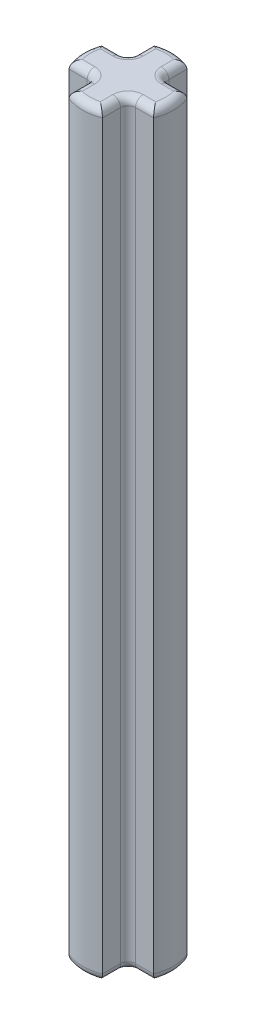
ISO-10303-21;
HEADER;
FILE_DESCRIPTION(('STEP AP214'),'2;1');
FILE_NAME('part.step','',(''),(''),'','','');
FILE_SCHEMA(('AUTOMOTIVE_DESIGN { 1 0 10303 214 1 1 1 1 }'));
ENDSEC;
DATA;
#1=APPLICATION_CONTEXT('core data for automotive mechanical design processes');
#2=APPLICATION_PROTOCOL_DEFINITION('international standard','automotive_design',2000,#1);
#3=PRODUCT_CONTEXT('',#1,'mechanical');
#4=PRODUCT('Part','Part','',(#3));
#5=PRODUCT_RELATED_PRODUCT_CATEGORY('part','',(#4));
#6=PRODUCT_DEFINITION_FORMATION('','',#4);
#7=PRODUCT_DEFINITION_CONTEXT('part definition',#1,'design');
#8=PRODUCT_DEFINITION('design','',#6,#7);
#9=PRODUCT_DEFINITION_SHAPE('','',#8);
#10=(LENGTH_UNIT() NAMED_UNIT(*) SI_UNIT(.MILLI.,.METRE.));
#11=(NAMED_UNIT(*) PLANE_ANGLE_UNIT() SI_UNIT($,.RADIAN.));
#12=(NAMED_UNIT(*) SI_UNIT($,.STERADIAN.) SOLID_ANGLE_UNIT());
#13=UNCERTAINTY_MEASURE_WITH_UNIT(LENGTH_MEASURE(1.E-05),#10,'distance_accuracy_value','');
#14=(GEOMETRIC_REPRESENTATION_CONTEXT(3) GLOBAL_UNCERTAINTY_ASSIGNED_CONTEXT((#13)) GLOBAL_UNIT_ASSIGNED_CONTEXT((#10,
#11,#12)) REPRESENTATION_CONTEXT('',''));
#15=CARTESIAN_POINT('',(0.,0.,0.));
#16=DIRECTION('',(0.,0.,1.));
#17=DIRECTION('',(1.,0.,0.));
#18=AXIS2_PLACEMENT_3D('',#15,#16,#17);
#19=CARTESIAN_POINT('',(0.,0.,0.));
#20=DIRECTION('',(0.,1.,0.));
#21=DIRECTION('',(0.,0.,1.));
#22=AXIS2_PLACEMENT_3D('',#19,#20,#21);
#23=PLANE('',#22);
#24=CARTESIAN_POINT('',(-1.28,0.,1.28));
#25=DIRECTION('',(0.,1.,0.));
#26=DIRECTION('',(0.,0.,1.));
#27=AXIS2_PLACEMENT_3D('',#24,#25,#26);
#28=CIRCLE('',#27,0.8);
#29=CARTESIAN_POINT('',(-1.28,0.,0.480000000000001));
#30=VERTEX_POINT('',#29);
#31=CARTESIAN_POINT('',(-0.48,0.,1.28));
#32=VERTEX_POINT('',#31);
#33=EDGE_CURVE('E260',#30,#32,#28,.F.);
#34=ORIENTED_EDGE('',*,*,#33,.F.);
#35=DIRECTION('',(1.,0.,0.));
#36=VECTOR('',#35,1.);
#37=CARTESIAN_POINT('',(0.,0.,0.480000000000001));
#38=LINE('',#37,#36);
#39=CARTESIAN_POINT('',(-1.94154577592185,0.,0.480000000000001));
#40=VERTEX_POINT('',#39);
#41=EDGE_CURVE('E322',#30,#40,#38,.F.);
#42=ORIENTED_EDGE('',*,*,#41,.T.);
#43=CARTESIAN_POINT('',(0.,0.,0.));
#44=DIRECTION('',(0.,1.,0.));
#45=DIRECTION('',(0.,0.,1.));
#46=AXIS2_PLACEMENT_3D('',#43,#44,#45);
#47=CIRCLE('',#46,2.);
#48=CARTESIAN_POINT('',(-1.94154577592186,0.,-0.48));
#49=VERTEX_POINT('',#48);
#50=EDGE_CURVE('E311',#40,#49,#47,.F.);
#51=ORIENTED_EDGE('',*,*,#50,.T.);
#52=DIRECTION('',(-1.,0.,0.));
#53=VECTOR('',#52,1.);
#54=CARTESIAN_POINT('',(0.,0.,-0.48));
#55=LINE('',#54,#53);
#56=CARTESIAN_POINT('',(-1.28,0.,-0.48));
#57=VERTEX_POINT('',#56);
#58=EDGE_CURVE('E299',#49,#57,#55,.F.);
#59=ORIENTED_EDGE('',*,*,#58,.T.);
#60=CARTESIAN_POINT('',(-1.28,0.,-1.28));
#61=DIRECTION('',(0.,1.,0.));
#62=DIRECTION('',(0.,0.,1.));
#63=AXIS2_PLACEMENT_3D('',#60,#61,#62);
#64=CIRCLE('',#63,0.8);
#65=CARTESIAN_POINT('',(-0.48,0.,-1.28));
#66=VERTEX_POINT('',#65);
#67=EDGE_CURVE('E296',#66,#57,#64,.F.);
#68=ORIENTED_EDGE('',*,*,#67,.F.);
#69=DIRECTION('',(0.,0.,1.));
#70=VECTOR('',#69,1.);
#71=CARTESIAN_POINT('',(-0.48,0.,0.));
#72=LINE('',#71,#70);
#73=CARTESIAN_POINT('',(-0.48,0.,-1.94154577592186));
#74=VERTEX_POINT('',#73);
#75=EDGE_CURVE('E287',#66,#74,#72,.F.);
#76=ORIENTED_EDGE('',*,*,#75,.T.);
#77=CARTESIAN_POINT('',(0.,0.,0.));
#78=DIRECTION('',(0.,1.,0.));
#79=DIRECTION('',(0.,0.,1.));
#80=AXIS2_PLACEMENT_3D('',#77,#78,#79);
#81=CIRCLE('',#80,2.);
#82=CARTESIAN_POINT('',(0.480000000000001,0.,-1.94154577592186));
#83=VERTEX_POINT('',#82);
#84=EDGE_CURVE('E292',#74,#83,#81,.F.);
#85=ORIENTED_EDGE('',*,*,#84,.T.);
#86=DIRECTION('',(0.,0.,-1.));
#87=VECTOR('',#86,1.);
#88=CARTESIAN_POINT('',(0.480000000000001,0.,0.));
#89=LINE('',#88,#87);
#90=CARTESIAN_POINT('',(0.480000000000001,0.,-1.28));
#91=VERTEX_POINT('',#90);
#92=EDGE_CURVE('E294',#83,#91,#89,.F.);
#93=ORIENTED_EDGE('',*,*,#92,.T.);
#94=CARTESIAN_POINT('',(1.28,0.,-1.28));
#95=DIRECTION('',(0.,1.,0.));
#96=DIRECTION('',(0.,0.,1.));
#97=AXIS2_PLACEMENT_3D('',#94,#95,#96);
#98=CIRCLE('',#97,0.8);
#99=CARTESIAN_POINT('',(1.28,0.,-0.48));
#100=VERTEX_POINT('',#99);
#101=EDGE_CURVE('E302',#100,#91,#98,.F.);
#102=ORIENTED_EDGE('',*,*,#101,.F.);
#103=DIRECTION('',(-1.,0.,0.));
#104=VECTOR('',#103,1.);
#105=CARTESIAN_POINT('',(0.,0.,-0.48));
#106=LINE('',#105,#104);
#107=CARTESIAN_POINT('',(1.94154577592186,0.,-0.48));
#108=VERTEX_POINT('',#107);
#109=EDGE_CURVE('E305',#100,#108,#106,.F.);
#110=ORIENTED_EDGE('',*,*,#109,.T.);
#111=CARTESIAN_POINT('',(0.,0.,0.));
#112=DIRECTION('',(0.,1.,0.));
#113=DIRECTION('',(0.,0.,1.));
#114=AXIS2_PLACEMENT_3D('',#111,#112,#113);
#115=CIRCLE('',#114,2.);
#116=CARTESIAN_POINT('',(1.94154577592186,0.,0.480000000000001));
#117=VERTEX_POINT('',#116);
#118=EDGE_CURVE('E307',#108,#117,#115,.F.);
#119=ORIENTED_EDGE('',*,*,#118,.T.);
#120=DIRECTION('',(1.,0.,0.));
#121=VECTOR('',#120,1.);
#122=CARTESIAN_POINT('',(0.,0.,0.480000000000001));
#123=LINE('',#122,#121);
#124=CARTESIAN_POINT('',(1.28,0.,0.480000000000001));
#125=VERTEX_POINT('',#124);
#126=EDGE_CURVE('E309',#117,#125,#123,.F.);
#127=ORIENTED_EDGE('',*,*,#126,.T.);
#128=CARTESIAN_POINT('',(1.28,0.,1.28));
#129=DIRECTION('',(0.,1.,0.));
#130=DIRECTION('',(0.,0.,1.));
#131=AXIS2_PLACEMENT_3D('',#128,#129,#130);
#132=CIRCLE('',#131,0.8);
#133=CARTESIAN_POINT('',(0.480000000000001,0.,1.28));
#134=VERTEX_POINT('',#133);
#135=EDGE_CURVE('E313',#134,#125,#132,.F.);
#136=ORIENTED_EDGE('',*,*,#135,.F.);
#137=DIRECTION('',(0.,0.,-1.));
#138=VECTOR('',#137,1.);
#139=CARTESIAN_POINT('',(0.480000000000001,0.,0.));
#140=LINE('',#139,#138);
#141=CARTESIAN_POINT('',(0.480000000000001,0.,1.94154577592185));
#142=VERTEX_POINT('',#141);
#143=EDGE_CURVE('E316',#134,#142,#140,.F.);
#144=ORIENTED_EDGE('',*,*,#143,.T.);
#145=CARTESIAN_POINT('',(0.,0.,0.));
#146=DIRECTION('',(0.,1.,0.));
#147=DIRECTION('',(0.,0.,1.));
#148=AXIS2_PLACEMENT_3D('',#145,#146,#147);
#149=CIRCLE('',#148,2.);
#150=CARTESIAN_POINT('',(-0.48,0.,1.94154577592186));
#151=VERTEX_POINT('',#150);
#152=EDGE_CURVE('E318',#142,#151,#149,.F.);
#153=ORIENTED_EDGE('',*,*,#152,.T.);
#154=DIRECTION('',(0.,0.,1.));
#155=VECTOR('',#154,1.);
#156=CARTESIAN_POINT('',(-0.48,0.,0.));
#157=LINE('',#156,#155);
#158=EDGE_CURVE('E320',#151,#32,#157,.F.);
#159=ORIENTED_EDGE('',*,*,#158,.T.);
#160=EDGE_LOOP('',(#34,#42,#51,#59,#68,#76,#85,#93,#102,#110,#119,#127,#136,#144,#153,#159));
#161=FACE_BOUND('',#160,.T.);
#162=ADVANCED_FACE('F34',(#161),#23,.F.);
#163=CARTESIAN_POINT('',(-0.88,40.,-2.23284571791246));
#164=DIRECTION('',(1.,0.,0.));
#165=DIRECTION('',(0.,0.,-1.));
#166=AXIS2_PLACEMENT_3D('',#163,#164,#165);
#167=PLANE('',#166);
#168=DIRECTION('',(0.,-1.,0.));
#169=VECTOR('',#168,1.);
#170=CARTESIAN_POINT('',(-0.88,40.,-2.23284571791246));
#171=LINE('',#170,#169);
#172=CARTESIAN_POINT('',(-0.88,39.6,-2.23284571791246));
#173=VERTEX_POINT('',#172);
#174=CARTESIAN_POINT('',(-0.88,0.399999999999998,-2.23284571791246));
#175=VERTEX_POINT('',#174);
#176=EDGE_CURVE('E682',#173,#175,#171,.T.);
#177=ORIENTED_EDGE('',*,*,#176,.T.);
#178=DIRECTION('',(0.,0.,1.));
#179=VECTOR('',#178,1.);
#180=CARTESIAN_POINT('',(-0.88,0.399999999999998,-2.23284571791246));
#181=LINE('',#180,#179);
#182=CARTESIAN_POINT('',(-0.88,0.399999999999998,-1.28));
#183=VERTEX_POINT('',#182);
#184=EDGE_CURVE('E382',#175,#183,#181,.T.);
#185=ORIENTED_EDGE('',*,*,#184,.T.);
#186=DIRECTION('',(0.,-1.,0.));
#187=VECTOR('',#186,1.);
#188=CARTESIAN_POINT('',(-0.88,40.,-1.28));
#189=LINE('',#188,#187);
#190=CARTESIAN_POINT('',(-0.88,39.6,-1.28));
#191=VERTEX_POINT('',#190);
#192=EDGE_CURVE('E378',#183,#191,#189,.F.);
#193=ORIENTED_EDGE('',*,*,#192,.T.);
#194=DIRECTION('',(0.,0.,1.));
#195=VECTOR('',#194,1.);
#196=CARTESIAN_POINT('',(-0.88,39.6,-2.23284571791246));
#197=LINE('',#196,#195);
#198=EDGE_CURVE('E380',#191,#173,#197,.F.);
#199=ORIENTED_EDGE('',*,*,#198,.T.);
#200=EDGE_LOOP('',(#177,#185,#193,#199));
#201=FACE_BOUND('',#200,.T.);
#202=ADVANCED_FACE('F775',(#201),#167,.F.);
#203=CARTESIAN_POINT('',(-2.23284571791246,40.,-0.88));
#204=DIRECTION('',(0.,0.,1.));
#205=DIRECTION('',(1.,0.,0.));
#206=AXIS2_PLACEMENT_3D('',#203,#204,#205);
#207=PLANE('',#206);
#208=DIRECTION('',(0.,-1.,0.));
#209=VECTOR('',#208,1.);
#210=CARTESIAN_POINT('',(-1.28,0.,-0.88));
#211=LINE('',#210,#209);
#212=CARTESIAN_POINT('',(-1.28,39.6,-0.88));
#213=VERTEX_POINT('',#212);
#214=CARTESIAN_POINT('',(-1.28,0.399999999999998,-0.88));
#215=VERTEX_POINT('',#214);
#216=EDGE_CURVE('E270',#213,#215,#211,.T.);
#217=ORIENTED_EDGE('',*,*,#216,.T.);
#218=DIRECTION('',(-1.,0.,0.));
#219=VECTOR('',#218,1.);
#220=CARTESIAN_POINT('',(-2.23284571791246,0.399999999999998,-0.88));
#221=LINE('',#220,#219);
#222=CARTESIAN_POINT('',(-2.23284571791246,0.399999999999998,-0.88));
#223=VERTEX_POINT('',#222);
#224=EDGE_CURVE('E269',#215,#223,#221,.T.);
#225=ORIENTED_EDGE('',*,*,#224,.T.);
#226=DIRECTION('',(0.,-1.,0.));
#227=VECTOR('',#226,1.);
#228=CARTESIAN_POINT('',(-2.23284571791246,40.,-0.88));
#229=LINE('',#228,#227);
#230=CARTESIAN_POINT('',(-2.23284571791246,39.6,-0.88));
#231=VERTEX_POINT('',#230);
#232=EDGE_CURVE('E252',#231,#223,#229,.T.);
#233=ORIENTED_EDGE('',*,*,#232,.F.);
#234=DIRECTION('',(-1.,0.,0.));
#235=VECTOR('',#234,1.);
#236=CARTESIAN_POINT('',(-0.88,39.6,-0.88));
#237=LINE('',#236,#235);
#238=EDGE_CURVE('E266',#231,#213,#237,.F.);
#239=ORIENTED_EDGE('',*,*,#238,.T.);
#240=EDGE_LOOP('',(#217,#225,#233,#239));
#241=FACE_BOUND('',#240,.T.);
#242=ADVANCED_FACE('F264',(#241),#207,.F.);
#243=CARTESIAN_POINT('',(0.,40.,0.));
#244=DIRECTION('',(0.,-1.,0.));
#245=DIRECTION('',(0.,0.,-1.));
#246=AXIS2_PLACEMENT_3D('',#243,#244,#245);
#247=CYLINDRICAL_SURFACE('',#246,2.4);
#248=ORIENTED_EDGE('',*,*,#232,.T.);
#249=CARTESIAN_POINT('',(0.,0.399999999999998,0.));
#250=DIRECTION('',(0.,1.,0.));
#251=DIRECTION('',(0.,0.,1.));
#252=AXIS2_PLACEMENT_3D('',#249,#250,#251);
#253=CIRCLE('',#252,2.4);
#254=CARTESIAN_POINT('',(-2.23284571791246,0.399999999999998,0.880000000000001));
#255=VERTEX_POINT('',#254);
#256=EDGE_CURVE('E259',#223,#255,#253,.T.);
#257=ORIENTED_EDGE('',*,*,#256,.T.);
#258=DIRECTION('',(0.,-1.,0.));
#259=VECTOR('',#258,1.);
#260=CARTESIAN_POINT('',(-2.23284571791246,40.,0.880000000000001));
#261=LINE('',#260,#259);
#262=CARTESIAN_POINT('',(-2.23284571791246,39.6,0.880000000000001));
#263=VERTEX_POINT('',#262);
#264=EDGE_CURVE('E254',#263,#255,#261,.T.);
#265=ORIENTED_EDGE('',*,*,#264,.F.);
#266=CARTESIAN_POINT('',(0.,39.6,0.));
#267=DIRECTION('',(0.,1.,0.));
#268=DIRECTION('',(0.,0.,1.));
#269=AXIS2_PLACEMENT_3D('',#266,#267,#268);
#270=CIRCLE('',#269,2.4);
#271=EDGE_CURVE('E249',#263,#231,#270,.F.);
#272=ORIENTED_EDGE('',*,*,#271,.T.);
#273=EDGE_LOOP('',(#248,#257,#265,#272));
#274=FACE_BOUND('',#273,.T.);
#275=ADVANCED_FACE('F251',(#274),#247,.T.);
#276=CARTESIAN_POINT('',(-0.88,40.,0.880000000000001));
#277=DIRECTION('',(0.,0.,-1.));
#278=DIRECTION('',(-1.,0.,0.));
#279=AXIS2_PLACEMENT_3D('',#276,#277,#278);
#280=PLANE('',#279);
#281=ORIENTED_EDGE('',*,*,#264,.T.);
#282=DIRECTION('',(1.,0.,0.));
#283=VECTOR('',#282,1.);
#284=CARTESIAN_POINT('',(-0.88,0.399999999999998,0.880000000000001));
#285=LINE('',#284,#283);
#286=CARTESIAN_POINT('',(-1.28,0.399999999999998,0.880000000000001));
#287=VERTEX_POINT('',#286);
#288=EDGE_CURVE('E331',#255,#287,#285,.T.);
#289=ORIENTED_EDGE('',*,*,#288,.T.);
#290=DIRECTION('',(0.,-1.,0.));
#291=VECTOR('',#290,1.);
#292=CARTESIAN_POINT('',(-1.28,40.,0.880000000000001));
#293=LINE('',#292,#291);
#294=CARTESIAN_POINT('',(-1.28,39.6,0.880000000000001));
#295=VERTEX_POINT('',#294);
#296=EDGE_CURVE('E327',#287,#295,#293,.F.);
#297=ORIENTED_EDGE('',*,*,#296,.T.);
#298=DIRECTION('',(1.,0.,0.));
#299=VECTOR('',#298,1.);
#300=CARTESIAN_POINT('',(-2.23284571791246,39.6,0.880000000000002));
#301=LINE('',#300,#299);
#302=EDGE_CURVE('E329',#295,#263,#301,.F.);
#303=ORIENTED_EDGE('',*,*,#302,.T.);
#304=EDGE_LOOP('',(#281,#289,#297,#303));
#305=FACE_BOUND('',#304,.T.);
#306=ADVANCED_FACE('F708',(#305),#280,.F.);
#307=CARTESIAN_POINT('',(-0.88,40.,0.880000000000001));
#308=DIRECTION('',(1.,0.,0.));
#309=DIRECTION('',(0.,0.,-1.));
#310=AXIS2_PLACEMENT_3D('',#307,#308,#309);
#311=PLANE('',#310);
#312=DIRECTION('',(0.,-1.,0.));
#313=VECTOR('',#312,1.);
#314=CARTESIAN_POINT('',(-0.88,0.,1.28));
#315=LINE('',#314,#313);
#316=CARTESIAN_POINT('',(-0.88,39.6,1.28));
#317=VERTEX_POINT('',#316);
#318=CARTESIAN_POINT('',(-0.88,0.399999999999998,1.28));
#319=VERTEX_POINT('',#318);
#320=EDGE_CURVE('E333',#317,#319,#315,.T.);
#321=ORIENTED_EDGE('',*,*,#320,.T.);
#322=DIRECTION('',(0.,0.,1.));
#323=VECTOR('',#322,1.);
#324=CARTESIAN_POINT('',(-0.88,0.399999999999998,0.880000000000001));
#325=LINE('',#324,#323);
#326=CARTESIAN_POINT('',(-0.88,0.399999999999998,2.23284571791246));
#327=VERTEX_POINT('',#326);
#328=EDGE_CURVE('E337',#319,#327,#325,.T.);
#329=ORIENTED_EDGE('',*,*,#328,.T.);
#330=DIRECTION('',(0.,-1.,0.));
#331=VECTOR('',#330,1.);
#332=CARTESIAN_POINT('',(-0.88,40.,2.23284571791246));
#333=LINE('',#332,#331);
#334=CARTESIAN_POINT('',(-0.88,39.6,2.23284571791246));
#335=VERTEX_POINT('',#334);
#336=EDGE_CURVE('E703',#335,#327,#333,.T.);
#337=ORIENTED_EDGE('',*,*,#336,.F.);
#338=DIRECTION('',(0.,0.,1.));
#339=VECTOR('',#338,1.);
#340=CARTESIAN_POINT('',(-0.88,39.6,0.880000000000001));
#341=LINE('',#340,#339);
#342=EDGE_CURVE('E335',#335,#317,#341,.F.);
#343=ORIENTED_EDGE('',*,*,#342,.T.);
#344=EDGE_LOOP('',(#321,#329,#337,#343));
#345=FACE_BOUND('',#344,.T.);
#346=ADVANCED_FACE('F806',(#345),#311,.F.);
#347=CARTESIAN_POINT('',(0.,40.,0.));
#348=DIRECTION('',(0.,-1.,0.));
#349=DIRECTION('',(0.,0.,-1.));
#350=AXIS2_PLACEMENT_3D('',#347,#348,#349);
#351=CYLINDRICAL_SURFACE('',#350,2.4);
#352=ORIENTED_EDGE('',*,*,#336,.T.);
#353=CARTESIAN_POINT('',(0.,0.399999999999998,0.));
#354=DIRECTION('',(0.,1.,0.));
#355=DIRECTION('',(0.,0.,1.));
#356=AXIS2_PLACEMENT_3D('',#353,#354,#355);
#357=CIRCLE('',#356,2.4);
#358=CARTESIAN_POINT('',(0.88,0.399999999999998,2.23284571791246));
#359=VERTEX_POINT('',#358);
#360=EDGE_CURVE('E342',#327,#359,#357,.T.);
#361=ORIENTED_EDGE('',*,*,#360,.T.);
#362=DIRECTION('',(0.,-1.,0.));
#363=VECTOR('',#362,1.);
#364=CARTESIAN_POINT('',(0.88,40.,2.23284571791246));
#365=LINE('',#364,#363);
#366=CARTESIAN_POINT('',(0.88,39.6,2.23284571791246));
#367=VERTEX_POINT('',#366);
#368=EDGE_CURVE('E700',#367,#359,#365,.T.);
#369=ORIENTED_EDGE('',*,*,#368,.F.);
#370=CARTESIAN_POINT('',(0.,39.6,0.));
#371=DIRECTION('',(0.,1.,0.));
#372=DIRECTION('',(0.,0.,1.));
#373=AXIS2_PLACEMENT_3D('',#370,#371,#372);
#374=CIRCLE('',#373,2.4);
#375=EDGE_CURVE('E340',#367,#335,#374,.F.);
#376=ORIENTED_EDGE('',*,*,#375,.T.);
#377=EDGE_LOOP('',(#352,#361,#369,#376));
#378=FACE_BOUND('',#377,.T.);
#379=ADVANCED_FACE('F802',(#378),#351,.T.);
#380=CARTESIAN_POINT('',(0.880000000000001,40.,2.23284571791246));
#381=DIRECTION('',(-1.,0.,0.));
#382=DIRECTION('',(0.,0.,1.));
#383=AXIS2_PLACEMENT_3D('',#380,#381,#382);
#384=PLANE('',#383);
#385=ORIENTED_EDGE('',*,*,#368,.T.);
#386=DIRECTION('',(0.,0.,-1.));
#387=VECTOR('',#386,1.);
#388=CARTESIAN_POINT('',(0.880000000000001,0.399999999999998,2.23284571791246));
#389=LINE('',#388,#387);
#390=CARTESIAN_POINT('',(0.880000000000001,0.399999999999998,1.28));
#391=VERTEX_POINT('',#390);
#392=EDGE_CURVE('E348',#359,#391,#389,.T.);
#393=ORIENTED_EDGE('',*,*,#392,.T.);
#394=DIRECTION('',(0.,-1.,0.));
#395=VECTOR('',#394,1.);
#396=CARTESIAN_POINT('',(0.880000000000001,40.,1.28));
#397=LINE('',#396,#395);
#398=CARTESIAN_POINT('',(0.880000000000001,39.6,1.28));
#399=VERTEX_POINT('',#398);
#400=EDGE_CURVE('E344',#391,#399,#397,.F.);
#401=ORIENTED_EDGE('',*,*,#400,.T.);
#402=DIRECTION('',(0.,0.,-1.));
#403=VECTOR('',#402,1.);
#404=CARTESIAN_POINT('',(0.880000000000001,39.6,2.23284571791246));
#405=LINE('',#404,#403);
#406=EDGE_CURVE('E346',#399,#367,#405,.F.);
#407=ORIENTED_EDGE('',*,*,#406,.T.);
#408=EDGE_LOOP('',(#385,#393,#401,#407));
#409=FACE_BOUND('',#408,.T.);
#410=ADVANCED_FACE('F798',(#409),#384,.F.);
#411=CARTESIAN_POINT('',(2.23284571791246,40.,0.880000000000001));
#412=DIRECTION('',(0.,0.,-1.));
#413=DIRECTION('',(-1.,0.,0.));
#414=AXIS2_PLACEMENT_3D('',#411,#412,#413);
#415=PLANE('',#414);
#416=DIRECTION('',(0.,-1.,0.));
#417=VECTOR('',#416,1.);
#418=CARTESIAN_POINT('',(1.28,0.,0.880000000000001));
#419=LINE('',#418,#417);
#420=CARTESIAN_POINT('',(1.28,39.6,0.880000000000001));
#421=VERTEX_POINT('',#420);
#422=CARTESIAN_POINT('',(1.28,0.399999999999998,0.880000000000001));
#423=VERTEX_POINT('',#422);
#424=EDGE_CURVE('E350',#421,#423,#419,.T.);
#425=ORIENTED_EDGE('',*,*,#424,.T.);
#426=DIRECTION('',(1.,0.,0.));
#427=VECTOR('',#426,1.);
#428=CARTESIAN_POINT('',(2.23284571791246,0.399999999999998,0.880000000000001));
#429=LINE('',#428,#427);
#430=CARTESIAN_POINT('',(2.23284571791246,0.399999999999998,0.880000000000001));
#431=VERTEX_POINT('',#430);
#432=EDGE_CURVE('E354',#423,#431,#429,.T.);
#433=ORIENTED_EDGE('',*,*,#432,.T.);
#434=DIRECTION('',(0.,-1.,0.));
#435=VECTOR('',#434,1.);
#436=CARTESIAN_POINT('',(2.23284571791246,40.,0.880000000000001));
#437=LINE('',#436,#435);
#438=CARTESIAN_POINT('',(2.23284571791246,39.6,0.880000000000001));
#439=VERTEX_POINT('',#438);
#440=EDGE_CURVE('E697',#439,#431,#437,.T.);
#441=ORIENTED_EDGE('',*,*,#440,.F.);
#442=DIRECTION('',(1.,0.,0.));
#443=VECTOR('',#442,1.);
#444=CARTESIAN_POINT('',(0.880000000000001,39.6,0.880000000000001));
#445=LINE('',#444,#443);
#446=EDGE_CURVE('E352',#439,#421,#445,.F.);
#447=ORIENTED_EDGE('',*,*,#446,.T.);
#448=EDGE_LOOP('',(#425,#433,#441,#447));
#449=FACE_BOUND('',#448,.T.);
#450=ADVANCED_FACE('F794',(#449),#415,.F.);
#451=CARTESIAN_POINT('',(0.,40.,0.));
#452=DIRECTION('',(0.,-1.,0.));
#453=DIRECTION('',(0.,0.,-1.));
#454=AXIS2_PLACEMENT_3D('',#451,#452,#453);
#455=CYLINDRICAL_SURFACE('',#454,2.4);
#456=ORIENTED_EDGE('',*,*,#440,.T.);
#457=CARTESIAN_POINT('',(0.,0.399999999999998,0.));
#458=DIRECTION('',(0.,1.,0.));
#459=DIRECTION('',(0.,0.,1.));
#460=AXIS2_PLACEMENT_3D('',#457,#458,#459);
#461=CIRCLE('',#460,2.4);
#462=CARTESIAN_POINT('',(2.23284571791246,0.399999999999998,-0.88));
#463=VERTEX_POINT('',#462);
#464=EDGE_CURVE('E359',#431,#463,#461,.T.);
#465=ORIENTED_EDGE('',*,*,#464,.T.);
#466=DIRECTION('',(0.,-1.,0.));
#467=VECTOR('',#466,1.);
#468=CARTESIAN_POINT('',(2.23284571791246,40.,-0.88));
#469=LINE('',#468,#467);
#470=CARTESIAN_POINT('',(2.23284571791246,39.6,-0.88));
#471=VERTEX_POINT('',#470);
#472=EDGE_CURVE('E692',#471,#463,#469,.T.);
#473=ORIENTED_EDGE('',*,*,#472,.F.);
#474=CARTESIAN_POINT('',(0.,39.6,0.));
#475=DIRECTION('',(0.,1.,0.));
#476=DIRECTION('',(0.,0.,1.));
#477=AXIS2_PLACEMENT_3D('',#474,#475,#476);
#478=CIRCLE('',#477,2.4);
#479=EDGE_CURVE('E357',#471,#439,#478,.F.);
#480=ORIENTED_EDGE('',*,*,#479,.T.);
#481=EDGE_LOOP('',(#456,#465,#473,#480));
#482=FACE_BOUND('',#481,.T.);
#483=ADVANCED_FACE('F790',(#482),#455,.T.);
#484=CARTESIAN_POINT('',(0.880000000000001,40.,-0.88));
#485=DIRECTION('',(0.,0.,1.));
#486=DIRECTION('',(1.,0.,0.));
#487=AXIS2_PLACEMENT_3D('',#484,#485,#486);
#488=PLANE('',#487);
#489=ORIENTED_EDGE('',*,*,#472,.T.);
#490=DIRECTION('',(-1.,0.,0.));
#491=VECTOR('',#490,1.);
#492=CARTESIAN_POINT('',(0.880000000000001,0.399999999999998,-0.88));
#493=LINE('',#492,#491);
#494=CARTESIAN_POINT('',(1.28,0.399999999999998,-0.88));
#495=VERTEX_POINT('',#494);
#496=EDGE_CURVE('E365',#463,#495,#493,.T.);
#497=ORIENTED_EDGE('',*,*,#496,.T.);
#498=DIRECTION('',(0.,-1.,0.));
#499=VECTOR('',#498,1.);
#500=CARTESIAN_POINT('',(1.28,40.,-0.88));
#501=LINE('',#500,#499);
#502=CARTESIAN_POINT('',(1.28,39.6,-0.88));
#503=VERTEX_POINT('',#502);
#504=EDGE_CURVE('E361',#495,#503,#501,.F.);
#505=ORIENTED_EDGE('',*,*,#504,.T.);
#506=DIRECTION('',(-1.,0.,0.));
#507=VECTOR('',#506,1.);
#508=CARTESIAN_POINT('',(2.23284571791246,39.6,-0.88));
#509=LINE('',#508,#507);
#510=EDGE_CURVE('E363',#503,#471,#509,.F.);
#511=ORIENTED_EDGE('',*,*,#510,.T.);
#512=EDGE_LOOP('',(#489,#497,#505,#511));
#513=FACE_BOUND('',#512,.T.);
#514=ADVANCED_FACE('F787',(#513),#488,.F.);
#515=CARTESIAN_POINT('',(0.880000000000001,40.,-0.88));
#516=DIRECTION('',(-1.,0.,0.));
#517=DIRECTION('',(0.,0.,1.));
#518=AXIS2_PLACEMENT_3D('',#515,#516,#517);
#519=PLANE('',#518);
#520=DIRECTION('',(0.,-1.,0.));
#521=VECTOR('',#520,1.);
#522=CARTESIAN_POINT('',(0.880000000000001,0.,-1.28));
#523=LINE('',#522,#521);
#524=CARTESIAN_POINT('',(0.880000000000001,39.6,-1.28));
#525=VERTEX_POINT('',#524);
#526=CARTESIAN_POINT('',(0.880000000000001,0.399999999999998,-1.28));
#527=VERTEX_POINT('',#526);
#528=EDGE_CURVE('E367',#525,#527,#523,.T.);
#529=ORIENTED_EDGE('',*,*,#528,.T.);
#530=DIRECTION('',(0.,0.,-1.));
#531=VECTOR('',#530,1.);
#532=CARTESIAN_POINT('',(0.880000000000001,0.399999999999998,-0.88));
#533=LINE('',#532,#531);
#534=CARTESIAN_POINT('',(0.880000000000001,0.399999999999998,-2.23284571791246));
#535=VERTEX_POINT('',#534);
#536=EDGE_CURVE('E371',#527,#535,#533,.T.);
#537=ORIENTED_EDGE('',*,*,#536,.T.);
#538=DIRECTION('',(0.,-1.,0.));
#539=VECTOR('',#538,1.);
#540=CARTESIAN_POINT('',(0.880000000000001,40.,-2.23284571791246));
#541=LINE('',#540,#539);
#542=CARTESIAN_POINT('',(0.880000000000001,39.6,-2.23284571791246));
#543=VERTEX_POINT('',#542);
#544=EDGE_CURVE('E686',#543,#535,#541,.T.);
#545=ORIENTED_EDGE('',*,*,#544,.F.);
#546=DIRECTION('',(0.,0.,-1.));
#547=VECTOR('',#546,1.);
#548=CARTESIAN_POINT('',(0.880000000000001,39.6,-0.88));
#549=LINE('',#548,#547);
#550=EDGE_CURVE('E369',#543,#525,#549,.F.);
#551=ORIENTED_EDGE('',*,*,#550,.T.);
#552=EDGE_LOOP('',(#529,#537,#545,#551));
#553=FACE_BOUND('',#552,.T.);
#554=ADVANCED_FACE('F728',(#553),#519,.F.);
#555=CARTESIAN_POINT('',(0.,40.,0.));
#556=DIRECTION('',(0.,-1.,0.));
#557=DIRECTION('',(0.,0.,-1.));
#558=AXIS2_PLACEMENT_3D('',#555,#556,#557);
#559=CYLINDRICAL_SURFACE('',#558,2.4);
#560=ORIENTED_EDGE('',*,*,#544,.T.);
#561=CARTESIAN_POINT('',(0.,0.399999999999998,0.));
#562=DIRECTION('',(0.,1.,0.));
#563=DIRECTION('',(0.,0.,1.));
#564=AXIS2_PLACEMENT_3D('',#561,#562,#563);
#565=CIRCLE('',#564,2.4);
#566=EDGE_CURVE('E376',#535,#175,#565,.T.);
#567=ORIENTED_EDGE('',*,*,#566,.T.);
#568=ORIENTED_EDGE('',*,*,#176,.F.);
#569=CARTESIAN_POINT('',(0.,39.6,0.));
#570=DIRECTION('',(0.,1.,0.));
#571=DIRECTION('',(0.,0.,1.));
#572=AXIS2_PLACEMENT_3D('',#569,#570,#571);
#573=CIRCLE('',#572,2.4);
#574=EDGE_CURVE('E374',#173,#543,#573,.F.);
#575=ORIENTED_EDGE('',*,*,#574,.T.);
#576=EDGE_LOOP('',(#560,#567,#568,#575));
#577=FACE_BOUND('',#576,.T.);
#578=ADVANCED_FACE('F732',(#577),#559,.T.);
#579=CARTESIAN_POINT('',(0.,40.,0.));
#580=DIRECTION('',(0.,1.,0.));
#581=DIRECTION('',(0.,0.,1.));
#582=AXIS2_PLACEMENT_3D('',#579,#580,#581);
#583=PLANE('',#582);
#584=CARTESIAN_POINT('',(0.,40.,0.));
#585=DIRECTION('',(0.,1.,0.));
#586=DIRECTION('',(0.,0.,1.));
#587=AXIS2_PLACEMENT_3D('',#584,#585,#586);
#588=CIRCLE('',#587,2.);
#589=CARTESIAN_POINT('',(1.94154577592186,40.,0.480000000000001));
#590=VERTEX_POINT('',#589);
#591=CARTESIAN_POINT('',(1.94154577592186,40.,-0.48));
#592=VERTEX_POINT('',#591);
#593=EDGE_CURVE('E60',#590,#592,#588,.T.);
#594=ORIENTED_EDGE('',*,*,#593,.T.);
#595=DIRECTION('',(-1.,0.,0.));
#596=VECTOR('',#595,1.);
#597=CARTESIAN_POINT('',(0.880000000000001,40.,-0.48));
#598=LINE('',#597,#596);
#599=CARTESIAN_POINT('',(1.28,40.,-0.48));
#600=VERTEX_POINT('',#599);
#601=EDGE_CURVE('E11',#592,#600,#598,.T.);
#602=ORIENTED_EDGE('',*,*,#601,.T.);
#603=CARTESIAN_POINT('',(1.28,40.,-1.28));
#604=DIRECTION('',(0.,1.,0.));
#605=DIRECTION('',(0.,0.,1.));
#606=AXIS2_PLACEMENT_3D('',#603,#604,#605);
#607=CIRCLE('',#606,0.8);
#608=CARTESIAN_POINT('',(0.480000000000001,40.,-1.28));
#609=VERTEX_POINT('',#608);
#610=EDGE_CURVE('E49',#609,#600,#607,.T.);
#611=ORIENTED_EDGE('',*,*,#610,.F.);
#612=DIRECTION('',(0.,0.,-1.));
#613=VECTOR('',#612,1.);
#614=CARTESIAN_POINT('',(0.480000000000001,40.,-2.23284571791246));
#615=LINE('',#614,#613);
#616=CARTESIAN_POINT('',(0.480000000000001,40.,-1.94154577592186));
#617=VERTEX_POINT('',#616);
#618=EDGE_CURVE('E406',#609,#617,#615,.T.);
#619=ORIENTED_EDGE('',*,*,#618,.T.);
#620=CARTESIAN_POINT('',(0.,40.,0.));
#621=DIRECTION('',(0.,1.,0.));
#622=DIRECTION('',(0.,0.,1.));
#623=AXIS2_PLACEMENT_3D('',#620,#621,#622);
#624=CIRCLE('',#623,2.);
#625=CARTESIAN_POINT('',(-0.48,40.,-1.94154577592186));
#626=VERTEX_POINT('',#625);
#627=EDGE_CURVE('E394',#617,#626,#624,.T.);
#628=ORIENTED_EDGE('',*,*,#627,.T.);
#629=DIRECTION('',(0.,0.,1.));
#630=VECTOR('',#629,1.);
#631=CARTESIAN_POINT('',(-0.48,40.,-0.88));
#632=LINE('',#631,#630);
#633=CARTESIAN_POINT('',(-0.48,40.,-1.28));
#634=VERTEX_POINT('',#633);
#635=EDGE_CURVE('E387',#626,#634,#632,.T.);
#636=ORIENTED_EDGE('',*,*,#635,.T.);
#637=CARTESIAN_POINT('',(-1.28,40.,-1.28));
#638=DIRECTION('',(0.,1.,0.));
#639=DIRECTION('',(0.,0.,1.));
#640=AXIS2_PLACEMENT_3D('',#637,#638,#639);
#641=CIRCLE('',#640,0.8);
#642=CARTESIAN_POINT('',(-1.28,40.,-0.48));
#643=VERTEX_POINT('',#642);
#644=EDGE_CURVE('E384',#643,#634,#641,.T.);
#645=ORIENTED_EDGE('',*,*,#644,.F.);
#646=DIRECTION('',(-1.,0.,0.));
#647=VECTOR('',#646,1.);
#648=CARTESIAN_POINT('',(-2.23284571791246,40.,-0.48));
#649=LINE('',#648,#647);
#650=CARTESIAN_POINT('',(-1.94154577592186,40.,-0.48));
#651=VERTEX_POINT('',#650);
#652=EDGE_CURVE('E389',#643,#651,#649,.T.);
#653=ORIENTED_EDGE('',*,*,#652,.T.);
#654=CARTESIAN_POINT('',(0.,40.,0.));
#655=DIRECTION('',(0.,1.,0.));
#656=DIRECTION('',(0.,0.,1.));
#657=AXIS2_PLACEMENT_3D('',#654,#655,#656);
#658=CIRCLE('',#657,2.);
#659=CARTESIAN_POINT('',(-1.94154577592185,40.,0.480000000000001));
#660=VERTEX_POINT('',#659);
#661=EDGE_CURVE('E276',#651,#660,#658,.T.);
#662=ORIENTED_EDGE('',*,*,#661,.T.);
#663=DIRECTION('',(1.,0.,0.));
#664=VECTOR('',#663,1.);
#665=CARTESIAN_POINT('',(-0.88,40.,0.480000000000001));
#666=LINE('',#665,#664);
#667=CARTESIAN_POINT('',(-1.28,40.,0.480000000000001));
#668=VERTEX_POINT('',#667);
#669=EDGE_CURVE('E392',#660,#668,#666,.T.);
#670=ORIENTED_EDGE('',*,*,#669,.T.);
#671=CARTESIAN_POINT('',(-1.28,40.,1.28));
#672=DIRECTION('',(0.,1.,0.));
#673=DIRECTION('',(0.,0.,1.));
#674=AXIS2_PLACEMENT_3D('',#671,#672,#673);
#675=CIRCLE('',#674,0.8);
#676=CARTESIAN_POINT('',(-0.48,40.,1.28));
#677=VERTEX_POINT('',#676);
#678=EDGE_CURVE('E397',#677,#668,#675,.T.);
#679=ORIENTED_EDGE('',*,*,#678,.F.);
#680=DIRECTION('',(0.,0.,1.));
#681=VECTOR('',#680,1.);
#682=CARTESIAN_POINT('',(-0.48,40.,2.23284571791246));
#683=LINE('',#682,#681);
#684=CARTESIAN_POINT('',(-0.48,40.,1.94154577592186));
#685=VERTEX_POINT('',#684);
#686=EDGE_CURVE('E400',#677,#685,#683,.T.);
#687=ORIENTED_EDGE('',*,*,#686,.T.);
#688=CARTESIAN_POINT('',(0.,40.,0.));
#689=DIRECTION('',(0.,1.,0.));
#690=DIRECTION('',(0.,0.,1.));
#691=AXIS2_PLACEMENT_3D('',#688,#689,#690);
#692=CIRCLE('',#691,2.);
#693=CARTESIAN_POINT('',(0.48,40.,1.94154577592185));
#694=VERTEX_POINT('',#693);
#695=EDGE_CURVE('E402',#685,#694,#692,.T.);
#696=ORIENTED_EDGE('',*,*,#695,.T.);
#697=DIRECTION('',(0.,0.,-1.));
#698=VECTOR('',#697,1.);
#699=CARTESIAN_POINT('',(0.480000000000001,40.,0.880000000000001));
#700=LINE('',#699,#698);
#701=CARTESIAN_POINT('',(0.480000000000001,40.,1.28));
#702=VERTEX_POINT('',#701);
#703=EDGE_CURVE('E404',#694,#702,#700,.T.);
#704=ORIENTED_EDGE('',*,*,#703,.T.);
#705=CARTESIAN_POINT('',(1.28,40.,1.28));
#706=DIRECTION('',(0.,1.,0.));
#707=DIRECTION('',(0.,0.,1.));
#708=AXIS2_PLACEMENT_3D('',#705,#706,#707);
#709=CIRCLE('',#708,0.8);
#710=CARTESIAN_POINT('',(1.28,40.,0.480000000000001));
#711=VERTEX_POINT('',#710);
#712=EDGE_CURVE('E408',#711,#702,#709,.T.);
#713=ORIENTED_EDGE('',*,*,#712,.F.);
#714=DIRECTION('',(1.,0.,0.));
#715=VECTOR('',#714,1.);
#716=CARTESIAN_POINT('',(2.23284571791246,40.,0.480000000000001));
#717=LINE('',#716,#715);
#718=EDGE_CURVE('E411',#711,#590,#717,.T.);
#719=ORIENTED_EDGE('',*,*,#718,.T.);
#720=EDGE_LOOP('',(#594,#602,#611,#619,#628,#636,#645,#653,#662,#670,#679,#687,#696,#704,#713,#719));
#721=FACE_BOUND('',#720,.T.);
#722=ADVANCED_FACE('F782',(#721),#583,.T.);
#723=CARTESIAN_POINT('',(0.,39.6,0.480000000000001));
#724=DIRECTION('',(-1.,0.,0.));
#725=DIRECTION('',(0.,0.,1.));
#726=AXIS2_PLACEMENT_3D('',#723,#724,#725);
#727=CYLINDRICAL_SURFACE('',#726,0.4);
#728=CARTESIAN_POINT('',(1.28,39.6,0.480000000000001));
#729=DIRECTION('',(-1.,0.,0.));
#730=DIRECTION('',(0.,0.,1.));
#731=AXIS2_PLACEMENT_3D('',#728,#729,#730);
#732=CIRCLE('',#731,0.4);
#733=EDGE_CURVE('E675',#421,#711,#732,.T.);
#734=ORIENTED_EDGE('',*,*,#733,.F.);
#735=ORIENTED_EDGE('',*,*,#446,.F.);
#736=CARTESIAN_POINT('',(2.23284571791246,39.6,0.880000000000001));
#737=CARTESIAN_POINT('',(2.23286229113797,39.6196677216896,0.880027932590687));
#738=CARTESIAN_POINT('',(2.23185960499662,39.6393093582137,0.878551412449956));
#739=CARTESIAN_POINT('',(2.22795221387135,39.6778900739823,0.872817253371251));
#740=CARTESIAN_POINT('',(2.22505712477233,39.6968321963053,0.868573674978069));
#741=CARTESIAN_POINT('',(2.21750324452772,39.7335523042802,0.85753531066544));
#742=CARTESIAN_POINT('',(2.21284643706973,39.7513315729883,0.85074339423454));
#743=CARTESIAN_POINT('',(2.20197052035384,39.7853742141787,0.834948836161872));
#744=CARTESIAN_POINT('',(2.19574983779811,39.8016360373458,0.825943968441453));
#745=CARTESIAN_POINT('',(2.18156387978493,39.8332696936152,0.805515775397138));
#746=CARTESIAN_POINT('',(2.1735174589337,39.8485327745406,0.793981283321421));
#747=CARTESIAN_POINT('',(2.15618491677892,39.8768786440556,0.769295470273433));
#748=CARTESIAN_POINT('',(2.14689846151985,39.8899608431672,0.756143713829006));
#749=CARTESIAN_POINT('',(2.12572929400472,39.9158258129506,0.726380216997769));
#750=CARTESIAN_POINT('',(2.11366981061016,39.9282155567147,0.709553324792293));
#751=CARTESIAN_POINT('',(2.08850314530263,39.9499832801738,0.674765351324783));
#752=CARTESIAN_POINT('',(2.07539489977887,39.9593581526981,0.656803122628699));
#753=CARTESIAN_POINT('',(2.04585046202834,39.9766538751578,0.616725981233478));
#754=CARTESIAN_POINT('',(2.02925334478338,39.9839655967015,0.594467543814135));
#755=CARTESIAN_POINT('',(1.99535297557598,39.9945738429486,0.549587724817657));
#756=CARTESIAN_POINT('',(1.97805064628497,39.9978754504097,0.526966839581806));
#757=CARTESIAN_POINT('',(1.95507409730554,39.9996873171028,0.49733039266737));
#758=CARTESIAN_POINT('',(1.9495684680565,39.9999307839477,0.490258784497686));
#759=CARTESIAN_POINT('',(1.94321386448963,39.9999957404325,0.482131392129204));
#760=CARTESIAN_POINT('',(1.94237999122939,39.9999999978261,0.481065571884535));
#761=CARTESIAN_POINT('',(1.94154577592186,40.,0.480000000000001));
#762=B_SPLINE_CURVE_WITH_KNOTS('',3,(#736,#737,#738,#739,#740,#741,#742,#743,#744,#745,#746,
#747,#748,#749,#750,#751,#752,#753,#754,#755,#756,#757,#758,#759,#760,#761),.UNSPECIFIED.,.F.,
.F.,(4,2,2,2,2,2,2,2,2,2,2,2,4),(0.,0.0588812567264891,0.117465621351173,0.175984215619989,
0.234561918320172,0.296588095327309,0.358631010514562,0.4307411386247,0.502925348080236,
0.588744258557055,0.674454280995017,0.70134553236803,0.705405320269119),.UNSPECIFIED.);
#763=EDGE_CURVE('E39',#590,#439,#762,.F.);
#764=ORIENTED_EDGE('',*,*,#763,.F.);
#765=ORIENTED_EDGE('',*,*,#718,.F.);
#766=EDGE_LOOP('',(#734,#735,#764,#765));
#767=FACE_BOUND('',#766,.T.);
#768=ADVANCED_FACE('F36',(#767),#727,.T.);
#769=CARTESIAN_POINT('',(0.,39.6,0.));
#770=DIRECTION('',(0.,1.,0.));
#771=DIRECTION('',(0.,0.,1.));
#772=AXIS2_PLACEMENT_3D('',#769,#770,#771);
#773=TOROIDAL_SURFACE('',#772,2.,0.4);
#774=ORIENTED_EDGE('',*,*,#763,.T.);
#775=ORIENTED_EDGE('',*,*,#479,.F.);
#776=CARTESIAN_POINT('',(2.23284571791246,39.6,-0.88));
#777=CARTESIAN_POINT('',(2.23286229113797,39.6196677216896,-0.880027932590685));
#778=CARTESIAN_POINT('',(2.23185960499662,39.6393093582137,-0.878551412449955));
#779=CARTESIAN_POINT('',(2.22795221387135,39.6778900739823,-0.87281725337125));
#780=CARTESIAN_POINT('',(2.22505712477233,39.6968321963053,-0.868573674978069));
#781=CARTESIAN_POINT('',(2.21750324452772,39.7335523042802,-0.857535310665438));
#782=CARTESIAN_POINT('',(2.21284643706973,39.7513315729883,-0.850743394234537));
#783=CARTESIAN_POINT('',(2.20197052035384,39.7853742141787,-0.834948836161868));
#784=CARTESIAN_POINT('',(2.19574983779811,39.8016360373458,-0.825943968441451));
#785=CARTESIAN_POINT('',(2.18156387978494,39.8332696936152,-0.805515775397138));
#786=CARTESIAN_POINT('',(2.1735174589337,39.8485327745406,-0.79398128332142));
#787=CARTESIAN_POINT('',(2.15618491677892,39.8768786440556,-0.769295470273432));
#788=CARTESIAN_POINT('',(2.14689846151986,39.8899608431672,-0.756143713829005));
#789=CARTESIAN_POINT('',(2.12572929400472,39.9158258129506,-0.726380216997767));
#790=CARTESIAN_POINT('',(2.11366981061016,39.9282155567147,-0.709553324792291));
#791=CARTESIAN_POINT('',(2.08850314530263,39.9499832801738,-0.67476535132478));
#792=CARTESIAN_POINT('',(2.07539489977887,39.9593581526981,-0.656803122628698));
#793=CARTESIAN_POINT('',(2.04585046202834,39.9766538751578,-0.616725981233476));
#794=CARTESIAN_POINT('',(2.02925334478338,39.9839655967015,-0.594467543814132));
#795=CARTESIAN_POINT('',(1.99535297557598,39.9945738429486,-0.549587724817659));
#796=CARTESIAN_POINT('',(1.97805064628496,39.9978754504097,-0.526966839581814));
#797=CARTESIAN_POINT('',(1.95507409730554,39.9996873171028,-0.497330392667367));
#798=CARTESIAN_POINT('',(1.9495684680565,39.9999307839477,-0.490258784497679));
#799=CARTESIAN_POINT('',(1.94321386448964,39.9999957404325,-0.482131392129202));
#800=CARTESIAN_POINT('',(1.94237999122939,39.9999999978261,-0.481065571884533));
#801=CARTESIAN_POINT('',(1.94154577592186,40.,-0.48));
#802=B_SPLINE_CURVE_WITH_KNOTS('',3,(#776,#777,#778,#779,#780,#781,#782,#783,#784,#785,#786,
#787,#788,#789,#790,#791,#792,#793,#794,#795,#796,#797,#798,#799,#800,#801),.UNSPECIFIED.,.F.,
.F.,(4,2,2,2,2,2,2,2,2,2,2,2,4),(0.,0.0588812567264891,0.117465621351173,0.17598421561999,
0.234561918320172,0.296588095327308,0.358631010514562,0.430741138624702,0.502925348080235,
0.588744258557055,0.674454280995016,0.70134553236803,0.705405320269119),.UNSPECIFIED.);
#803=EDGE_CURVE('E669',#592,#471,#802,.F.);
#804=ORIENTED_EDGE('',*,*,#803,.F.);
#805=ORIENTED_EDGE('',*,*,#593,.F.);
#806=EDGE_LOOP('',(#774,#775,#804,#805));
#807=FACE_BOUND('',#806,.T.);
#808=ADVANCED_FACE('F659',(#807),#773,.T.);
#809=CARTESIAN_POINT('',(1.28,39.6,1.28));
#810=DIRECTION('',(0.,1.,0.));
#811=DIRECTION('',(0.,0.,1.));
#812=AXIS2_PLACEMENT_3D('',#809,#810,#811);
#813=TOROIDAL_SURFACE('',#812,0.8,0.4);
#814=ORIENTED_EDGE('',*,*,#733,.T.);
#815=ORIENTED_EDGE('',*,*,#712,.T.);
#816=CARTESIAN_POINT('',(0.480000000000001,39.6,1.28));
#817=DIRECTION('',(0.,0.,-1.));
#818=DIRECTION('',(-1.,0.,0.));
#819=AXIS2_PLACEMENT_3D('',#816,#817,#818);
#820=CIRCLE('',#819,0.4);
#821=EDGE_CURVE('E676',#399,#702,#820,.F.);
#822=ORIENTED_EDGE('',*,*,#821,.F.);
#823=CARTESIAN_POINT('',(1.28,39.6,1.28));
#824=DIRECTION('',(0.,1.,0.));
#825=DIRECTION('',(0.,0.,1.));
#826=AXIS2_PLACEMENT_3D('',#823,#824,#825);
#827=CIRCLE('',#826,0.4);
#828=EDGE_CURVE('E646',#421,#399,#827,.T.);
#829=ORIENTED_EDGE('',*,*,#828,.F.);
#830=EDGE_LOOP('',(#814,#815,#822,#829));
#831=FACE_BOUND('',#830,.T.);
#832=ADVANCED_FACE('F663',(#831),#813,.T.);
#833=CARTESIAN_POINT('',(0.,39.6,-0.48));
#834=DIRECTION('',(1.,0.,0.));
#835=DIRECTION('',(0.,0.,-1.));
#836=AXIS2_PLACEMENT_3D('',#833,#834,#835);
#837=CYLINDRICAL_SURFACE('',#836,0.4);
#838=ORIENTED_EDGE('',*,*,#803,.T.);
#839=ORIENTED_EDGE('',*,*,#510,.F.);
#840=CARTESIAN_POINT('',(1.28,39.6,-0.48));
#841=DIRECTION('',(-1.,0.,0.));
#842=DIRECTION('',(0.,0.,1.));
#843=AXIS2_PLACEMENT_3D('',#840,#841,#842);
#844=CIRCLE('',#843,0.4);
#845=EDGE_CURVE('E647',#600,#503,#844,.T.);
#846=ORIENTED_EDGE('',*,*,#845,.F.);
#847=ORIENTED_EDGE('',*,*,#601,.F.);
#848=EDGE_LOOP('',(#838,#839,#846,#847));
#849=FACE_BOUND('',#848,.T.);
#850=ADVANCED_FACE('F665',(#849),#837,.T.);
#851=CARTESIAN_POINT('',(0.480000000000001,39.6,0.));
#852=DIRECTION('',(0.,0.,1.));
#853=DIRECTION('',(1.,0.,0.));
#854=AXIS2_PLACEMENT_3D('',#851,#852,#853);
#855=CYLINDRICAL_SURFACE('',#854,0.4);
#856=ORIENTED_EDGE('',*,*,#821,.T.);
#857=ORIENTED_EDGE('',*,*,#703,.F.);
#858=CARTESIAN_POINT('',(0.88,39.6,2.23284571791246));
#859=CARTESIAN_POINT('',(0.880027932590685,39.6196677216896,2.23286229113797));
#860=CARTESIAN_POINT('',(0.878551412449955,39.6393093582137,2.23185960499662));
#861=CARTESIAN_POINT('',(0.872817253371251,39.6778900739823,2.22795221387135));
#862=CARTESIAN_POINT('',(0.868573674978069,39.6968321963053,2.22505712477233));
#863=CARTESIAN_POINT('',(0.857535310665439,39.7335523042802,2.21750324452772));
#864=CARTESIAN_POINT('',(0.850743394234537,39.7513315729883,2.21284643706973));
#865=CARTESIAN_POINT('',(0.834948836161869,39.7853742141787,2.20197052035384));
#866=CARTESIAN_POINT('',(0.825943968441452,39.8016360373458,2.19574983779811));
#867=CARTESIAN_POINT('',(0.805515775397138,39.8332696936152,2.18156387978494));
#868=CARTESIAN_POINT('',(0.793981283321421,39.8485327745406,2.1735174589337));
#869=CARTESIAN_POINT('',(0.769295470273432,39.8768786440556,2.15618491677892));
#870=CARTESIAN_POINT('',(0.756143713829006,39.8899608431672,2.14689846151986));
#871=CARTESIAN_POINT('',(0.726380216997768,39.9158258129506,2.12572929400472));
#872=CARTESIAN_POINT('',(0.709553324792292,39.9282155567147,2.11366981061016));
#873=CARTESIAN_POINT('',(0.674765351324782,39.9499832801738,2.08850314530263));
#874=CARTESIAN_POINT('',(0.656803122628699,39.9593581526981,2.07539489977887));
#875=CARTESIAN_POINT('',(0.616725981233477,39.9766538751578,2.04585046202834));
#876=CARTESIAN_POINT('',(0.594467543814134,39.9839655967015,2.02925334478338));
#877=CARTESIAN_POINT('',(0.549587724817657,39.9945738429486,1.99535297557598));
#878=CARTESIAN_POINT('',(0.526966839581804,39.9978754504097,1.97805064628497));
#879=CARTESIAN_POINT('',(0.49733039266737,39.9996873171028,1.95507409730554));
#880=CARTESIAN_POINT('',(0.490258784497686,39.9999307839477,1.9495684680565));
#881=CARTESIAN_POINT('',(0.482131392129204,39.9999957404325,1.94321386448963));
#882=CARTESIAN_POINT('',(0.481065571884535,39.9999999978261,1.94237999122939));
#883=CARTESIAN_POINT('',(0.480000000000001,40.,1.94154577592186));
#884=B_SPLINE_CURVE_WITH_KNOTS('',3,(#858,#859,#860,#861,#862,#863,#864,#865,#866,#867,#868,
#869,#870,#871,#872,#873,#874,#875,#876,#877,#878,#879,#880,#881,#882,#883),.UNSPECIFIED.,.F.,
.F.,(4,2,2,2,2,2,2,2,2,2,2,2,4),(0.,0.0588812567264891,0.117465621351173,0.17598421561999,
0.234561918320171,0.296588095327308,0.358631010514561,0.4307411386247,0.502925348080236,
0.588744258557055,0.674454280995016,0.701345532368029,0.705405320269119),.UNSPECIFIED.);
#885=EDGE_CURVE('E760',#367,#694,#884,.T.);
#886=ORIENTED_EDGE('',*,*,#885,.F.);
#887=ORIENTED_EDGE('',*,*,#406,.F.);
#888=EDGE_LOOP('',(#856,#857,#886,#887));
#889=FACE_BOUND('',#888,.T.);
#890=ADVANCED_FACE('F657',(#889),#855,.T.);
#891=CARTESIAN_POINT('',(1.28,40.,1.28));
#892=DIRECTION('',(0.,1.,0.));
#893=DIRECTION('',(0.,0.,1.));
#894=AXIS2_PLACEMENT_3D('',#891,#892,#893);
#895=CYLINDRICAL_SURFACE('',#894,0.4);
#896=ORIENTED_EDGE('',*,*,#828,.T.);
#897=ORIENTED_EDGE('',*,*,#400,.F.);
#898=CARTESIAN_POINT('',(1.28,0.399999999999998,1.28));
#899=DIRECTION('',(0.,1.,0.));
#900=DIRECTION('',(0.,0.,1.));
#901=AXIS2_PLACEMENT_3D('',#898,#899,#900);
#902=CIRCLE('',#901,0.4);
#903=EDGE_CURVE('E612',#423,#391,#902,.T.);
#904=ORIENTED_EDGE('',*,*,#903,.F.);
#905=ORIENTED_EDGE('',*,*,#424,.F.);
#906=EDGE_LOOP('',(#896,#897,#904,#905));
#907=FACE_BOUND('',#906,.T.);
#908=ADVANCED_FACE('F654',(#907),#895,.F.);
#909=CARTESIAN_POINT('',(2.23284571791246,0.399999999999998,0.480000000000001));
#910=DIRECTION('',(1.,0.,0.));
#911=DIRECTION('',(0.,0.,-1.));
#912=AXIS2_PLACEMENT_3D('',#909,#910,#911);
#913=CYLINDRICAL_SURFACE('',#912,0.4);
#914=CARTESIAN_POINT('',(1.28,0.4,0.480000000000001));
#915=DIRECTION('',(-1.,0.,0.));
#916=DIRECTION('',(0.,0.,1.));
#917=AXIS2_PLACEMENT_3D('',#914,#915,#916);
#918=CIRCLE('',#917,0.4);
#919=EDGE_CURVE('E608',#125,#423,#918,.T.);
#920=ORIENTED_EDGE('',*,*,#919,.F.);
#921=ORIENTED_EDGE('',*,*,#126,.F.);
#922=CARTESIAN_POINT('',(2.23284571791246,0.399999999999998,0.880000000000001));
#923=CARTESIAN_POINT('',(2.23286229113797,0.380332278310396,0.880027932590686));
#924=CARTESIAN_POINT('',(2.23185960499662,0.360690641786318,0.878551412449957));
#925=CARTESIAN_POINT('',(2.22795221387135,0.322109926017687,0.872817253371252));
#926=CARTESIAN_POINT('',(2.22505712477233,0.303167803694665,0.86857367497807));
#927=CARTESIAN_POINT('',(2.21750324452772,0.266447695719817,0.85753531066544));
#928=CARTESIAN_POINT('',(2.21284643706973,0.248668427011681,0.850743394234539));
#929=CARTESIAN_POINT('',(2.20197052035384,0.214625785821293,0.834948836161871));
#930=CARTESIAN_POINT('',(2.19574983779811,0.198363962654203,0.825943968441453));
#931=CARTESIAN_POINT('',(2.18156387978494,0.166730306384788,0.805515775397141));
#932=CARTESIAN_POINT('',(2.1735174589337,0.151467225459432,0.793981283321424));
#933=CARTESIAN_POINT('',(2.15618491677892,0.12312135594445,0.769295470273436));
#934=CARTESIAN_POINT('',(2.14689846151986,0.110039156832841,0.756143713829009));
#935=CARTESIAN_POINT('',(2.12572929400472,0.0841741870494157,0.726380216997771));
#936=CARTESIAN_POINT('',(2.11366981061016,0.0717844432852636,0.709553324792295));
#937=CARTESIAN_POINT('',(2.08850314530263,0.0500167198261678,0.674765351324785));
#938=CARTESIAN_POINT('',(2.07539489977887,0.0406418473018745,0.656803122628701));
#939=CARTESIAN_POINT('',(2.04585046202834,0.0233461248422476,0.616725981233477));
#940=CARTESIAN_POINT('',(2.02925334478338,0.0160344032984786,0.594467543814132));
#941=CARTESIAN_POINT('',(1.99535297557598,0.00542615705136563,0.549587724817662));
#942=CARTESIAN_POINT('',(1.97805064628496,0.00212454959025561,0.526966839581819));
#943=CARTESIAN_POINT('',(1.95507409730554,0.000312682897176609,0.497330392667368));
#944=CARTESIAN_POINT('',(1.94956846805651,6.92160523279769E-05,0.490258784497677));
#945=CARTESIAN_POINT('',(1.94321386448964,4.25956751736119E-06,0.482131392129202));
#946=CARTESIAN_POINT('',(1.94237999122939,2.17393375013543E-09,0.481065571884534));
#947=CARTESIAN_POINT('',(1.94154577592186,0.,0.480000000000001));
#948=B_SPLINE_CURVE_WITH_KNOTS('',3,(#922,#923,#924,#925,#926,#927,#928,#929,#930,#931,#932,
#933,#934,#935,#936,#937,#938,#939,#940,#941,#942,#943,#944,#945,#946,#947),.UNSPECIFIED.,.F.,
.F.,(4,2,2,2,2,2,2,2,2,2,2,2,4),(0.,0.0588812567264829,0.117465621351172,0.175984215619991,
0.234561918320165,0.296588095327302,0.358631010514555,0.430741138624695,0.502925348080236,
0.588744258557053,0.674454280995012,0.701345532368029,0.705405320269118),.UNSPECIFIED.);
#949=EDGE_CURVE('E637',#431,#117,#948,.T.);
#950=ORIENTED_EDGE('',*,*,#949,.F.);
#951=ORIENTED_EDGE('',*,*,#432,.F.);
#952=EDGE_LOOP('',(#920,#921,#950,#951));
#953=FACE_BOUND('',#952,.T.);
#954=ADVANCED_FACE('F632',(#953),#913,.T.);
#955=CARTESIAN_POINT('',(0.,0.399999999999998,0.));
#956=DIRECTION('',(0.,1.,0.));
#957=DIRECTION('',(0.,0.,1.));
#958=AXIS2_PLACEMENT_3D('',#955,#956,#957);
#959=TOROIDAL_SURFACE('',#958,2.,0.4);
#960=ORIENTED_EDGE('',*,*,#949,.T.);
#961=ORIENTED_EDGE('',*,*,#118,.F.);
#962=CARTESIAN_POINT('',(2.23284571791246,0.399999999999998,-0.88));
#963=CARTESIAN_POINT('',(2.23286229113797,0.380332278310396,-0.880027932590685));
#964=CARTESIAN_POINT('',(2.23185960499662,0.360690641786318,-0.878551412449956));
#965=CARTESIAN_POINT('',(2.22795221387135,0.322109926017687,-0.872817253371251));
#966=CARTESIAN_POINT('',(2.22505712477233,0.303167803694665,-0.868573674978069));
#967=CARTESIAN_POINT('',(2.21750324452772,0.266447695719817,-0.857535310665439));
#968=CARTESIAN_POINT('',(2.21284643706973,0.248668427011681,-0.850743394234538));
#969=CARTESIAN_POINT('',(2.20197052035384,0.214625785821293,-0.83494883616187));
#970=CARTESIAN_POINT('',(2.19574983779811,0.198363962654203,-0.825943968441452));
#971=CARTESIAN_POINT('',(2.18156387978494,0.166730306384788,-0.80551577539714));
#972=CARTESIAN_POINT('',(2.1735174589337,0.151467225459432,-0.793981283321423));
#973=CARTESIAN_POINT('',(2.15618491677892,0.123121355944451,-0.769295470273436));
#974=CARTESIAN_POINT('',(2.14689846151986,0.110039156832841,-0.756143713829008));
#975=CARTESIAN_POINT('',(2.12572929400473,0.0841741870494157,-0.72638021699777));
#976=CARTESIAN_POINT('',(2.11366981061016,0.0717844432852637,-0.709553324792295));
#977=CARTESIAN_POINT('',(2.08850314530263,0.0500167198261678,-0.674765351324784));
#978=CARTESIAN_POINT('',(2.07539489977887,0.0406418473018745,-0.6568031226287));
#979=CARTESIAN_POINT('',(2.04585046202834,0.0233461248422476,-0.616725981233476));
#980=CARTESIAN_POINT('',(2.02925334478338,0.0160344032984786,-0.594467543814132));
#981=CARTESIAN_POINT('',(1.99535297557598,0.00542615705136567,-0.549587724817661));
#982=CARTESIAN_POINT('',(1.97805064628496,0.00212454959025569,-0.526966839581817));
#983=CARTESIAN_POINT('',(1.95507409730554,0.000312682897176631,-0.497330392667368));
#984=CARTESIAN_POINT('',(1.94956846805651,6.92160523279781E-05,-0.490258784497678));
#985=CARTESIAN_POINT('',(1.94321386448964,4.2595675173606E-06,-0.482131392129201));
#986=CARTESIAN_POINT('',(1.94237999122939,2.1739337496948E-09,-0.481065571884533));
#987=CARTESIAN_POINT('',(1.94154577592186,0.,-0.48));
#988=B_SPLINE_CURVE_WITH_KNOTS('',3,(#962,#963,#964,#965,#966,#967,#968,#969,#970,#971,#972,
#973,#974,#975,#976,#977,#978,#979,#980,#981,#982,#983,#984,#985,#986,#987),.UNSPECIFIED.,.F.,
.F.,(4,2,2,2,2,2,2,2,2,2,2,2,4),(0.,0.058881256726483,0.117465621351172,0.175984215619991,
0.234561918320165,0.296588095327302,0.358631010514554,0.430741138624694,0.502925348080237,
0.588744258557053,0.674454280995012,0.701345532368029,0.705405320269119),.UNSPECIFIED.);
#989=EDGE_CURVE('E606',#463,#108,#988,.T.);
#990=ORIENTED_EDGE('',*,*,#989,.F.);
#991=ORIENTED_EDGE('',*,*,#464,.F.);
#992=EDGE_LOOP('',(#960,#961,#990,#991));
#993=FACE_BOUND('',#992,.T.);
#994=ADVANCED_FACE('F627',(#993),#959,.T.);
#995=CARTESIAN_POINT('',(1.28,39.6,-1.28));
#996=DIRECTION('',(0.,1.,0.));
#997=DIRECTION('',(0.,0.,1.));
#998=AXIS2_PLACEMENT_3D('',#995,#996,#997);
#999=TOROIDAL_SURFACE('',#998,0.8,0.4);
#1000=ORIENTED_EDGE('',*,*,#610,.T.);
#1001=ORIENTED_EDGE('',*,*,#845,.T.);
#1002=CARTESIAN_POINT('',(1.28,39.6,-1.28));
#1003=DIRECTION('',(0.,1.,0.));
#1004=DIRECTION('',(0.,0.,1.));
#1005=AXIS2_PLACEMENT_3D('',#1002,#1003,#1004);
#1006=CIRCLE('',#1005,0.4);
#1007=EDGE_CURVE('E609',#525,#503,#1006,.T.);
#1008=ORIENTED_EDGE('',*,*,#1007,.F.);
#1009=CARTESIAN_POINT('',(0.480000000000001,39.6,-1.28));
#1010=DIRECTION('',(0.,0.,1.));
#1011=DIRECTION('',(1.,0.,0.));
#1012=AXIS2_PLACEMENT_3D('',#1009,#1010,#1011);
#1013=CIRCLE('',#1012,0.4);
#1014=EDGE_CURVE('E615',#609,#525,#1013,.F.);
#1015=ORIENTED_EDGE('',*,*,#1014,.F.);
#1016=EDGE_LOOP('',(#1000,#1001,#1008,#1015));
#1017=FACE_BOUND('',#1016,.T.);
#1018=ADVANCED_FACE('F631',(#1017),#999,.T.);
#1019=CARTESIAN_POINT('',(0.,39.6,0.));
#1020=DIRECTION('',(0.,1.,0.));
#1021=DIRECTION('',(0.,0.,1.));
#1022=AXIS2_PLACEMENT_3D('',#1019,#1020,#1021);
#1023=TOROIDAL_SURFACE('',#1022,2.,0.4);
#1024=ORIENTED_EDGE('',*,*,#885,.T.);
#1025=ORIENTED_EDGE('',*,*,#695,.F.);
#1026=CARTESIAN_POINT('',(-0.88,39.6,2.23284571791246));
#1027=CARTESIAN_POINT('',(-0.880027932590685,39.6196677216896,2.23286229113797));
#1028=CARTESIAN_POINT('',(-0.878551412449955,39.6393093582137,2.23185960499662));
#1029=CARTESIAN_POINT('',(-0.87281725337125,39.6778900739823,2.22795221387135));
#1030=CARTESIAN_POINT('',(-0.868573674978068,39.6968321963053,2.22505712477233));
#1031=CARTESIAN_POINT('',(-0.857535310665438,39.7335523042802,2.21750324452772));
#1032=CARTESIAN_POINT('',(-0.850743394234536,39.7513315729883,2.21284643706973));
#1033=CARTESIAN_POINT('',(-0.834948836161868,39.7853742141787,2.20197052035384));
#1034=CARTESIAN_POINT('',(-0.825943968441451,39.8016360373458,2.19574983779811));
#1035=CARTESIAN_POINT('',(-0.805515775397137,39.8332696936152,2.18156387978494));
#1036=CARTESIAN_POINT('',(-0.79398128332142,39.8485327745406,2.1735174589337));
#1037=CARTESIAN_POINT('',(-0.769295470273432,39.8768786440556,2.15618491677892));
#1038=CARTESIAN_POINT('',(-0.756143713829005,39.8899608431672,2.14689846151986));
#1039=CARTESIAN_POINT('',(-0.726380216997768,39.9158258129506,2.12572929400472));
#1040=CARTESIAN_POINT('',(-0.709553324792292,39.9282155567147,2.11366981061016));
#1041=CARTESIAN_POINT('',(-0.674765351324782,39.9499832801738,2.08850314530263));
#1042=CARTESIAN_POINT('',(-0.656803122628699,39.9593581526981,2.07539489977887));
#1043=CARTESIAN_POINT('',(-0.616725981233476,39.9766538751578,2.04585046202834));
#1044=CARTESIAN_POINT('',(-0.594467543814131,39.9839655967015,2.02925334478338));
#1045=CARTESIAN_POINT('',(-0.549587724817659,39.9945738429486,1.99535297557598));
#1046=CARTESIAN_POINT('',(-0.526966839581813,39.9978754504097,1.97805064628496));
#1047=CARTESIAN_POINT('',(-0.497330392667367,39.9996873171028,1.95507409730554));
#1048=CARTESIAN_POINT('',(-0.490258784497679,39.9999307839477,1.9495684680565));
#1049=CARTESIAN_POINT('',(-0.482131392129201,39.9999957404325,1.94321386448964));
#1050=CARTESIAN_POINT('',(-0.481065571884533,39.9999999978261,1.94237999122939));
#1051=CARTESIAN_POINT('',(-0.48,40.,1.94154577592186));
#1052=B_SPLINE_CURVE_WITH_KNOTS('',3,(#1026,#1027,#1028,#1029,#1030,#1031,#1032,#1033,#1034,
#1035,#1036,#1037,#1038,#1039,#1040,#1041,#1042,#1043,#1044,#1045,#1046,#1047,#1048,#1049,#1050,
#1051),.UNSPECIFIED.,.F.,.F.,(4,2,2,2,2,2,2,2,2,2,2,2,4),(0.,0.0588812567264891,
0.117465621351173,0.17598421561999,0.234561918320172,0.296588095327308,0.358631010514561,
0.4307411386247,0.502925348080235,0.588744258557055,0.674454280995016,0.70134553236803,
0.705405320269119),.UNSPECIFIED.);
#1053=EDGE_CURVE('E745',#335,#685,#1052,.T.);
#1054=ORIENTED_EDGE('',*,*,#1053,.F.);
#1055=ORIENTED_EDGE('',*,*,#375,.F.);
#1056=EDGE_LOOP('',(#1024,#1025,#1054,#1055));
#1057=FACE_BOUND('',#1056,.T.);
#1058=ADVANCED_FACE('F754',(#1057),#1023,.T.);
#1059=CARTESIAN_POINT('',(1.28,0.399999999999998,1.28));
#1060=DIRECTION('',(0.,1.,0.));
#1061=DIRECTION('',(0.,0.,1.));
#1062=AXIS2_PLACEMENT_3D('',#1059,#1060,#1061);
#1063=TOROIDAL_SURFACE('',#1062,0.8,0.4);
#1064=ORIENTED_EDGE('',*,*,#919,.T.);
#1065=ORIENTED_EDGE('',*,*,#903,.T.);
#1066=CARTESIAN_POINT('',(0.480000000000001,0.399999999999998,1.28));
#1067=DIRECTION('',(0.,0.,-1.));
#1068=DIRECTION('',(-1.,0.,0.));
#1069=AXIS2_PLACEMENT_3D('',#1066,#1067,#1068);
#1070=CIRCLE('',#1069,0.4);
#1071=EDGE_CURVE('E740',#134,#391,#1070,.F.);
#1072=ORIENTED_EDGE('',*,*,#1071,.F.);
#1073=ORIENTED_EDGE('',*,*,#135,.T.);
#1074=EDGE_LOOP('',(#1064,#1065,#1072,#1073));
#1075=FACE_BOUND('',#1074,.T.);
#1076=ADVANCED_FACE('F633',(#1075),#1063,.T.);
#1077=CARTESIAN_POINT('',(0.880000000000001,0.399999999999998,-0.48));
#1078=DIRECTION('',(-1.,0.,0.));
#1079=DIRECTION('',(0.,0.,1.));
#1080=AXIS2_PLACEMENT_3D('',#1077,#1078,#1079);
#1081=CYLINDRICAL_SURFACE('',#1080,0.4);
#1082=ORIENTED_EDGE('',*,*,#989,.T.);
#1083=ORIENTED_EDGE('',*,*,#109,.F.);
#1084=CARTESIAN_POINT('',(1.28,0.399999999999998,-0.48));
#1085=DIRECTION('',(-1.,0.,0.));
#1086=DIRECTION('',(0.,0.,1.));
#1087=AXIS2_PLACEMENT_3D('',#1084,#1085,#1086);
#1088=CIRCLE('',#1087,0.4);
#1089=EDGE_CURVE('E597',#495,#100,#1088,.T.);
#1090=ORIENTED_EDGE('',*,*,#1089,.F.);
#1091=ORIENTED_EDGE('',*,*,#496,.F.);
#1092=EDGE_LOOP('',(#1082,#1083,#1090,#1091));
#1093=FACE_BOUND('',#1092,.T.);
#1094=ADVANCED_FACE('F603',(#1093),#1081,.T.);
#1095=CARTESIAN_POINT('',(1.28,40.,-1.28));
#1096=DIRECTION('',(0.,1.,0.));
#1097=DIRECTION('',(0.,0.,1.));
#1098=AXIS2_PLACEMENT_3D('',#1095,#1096,#1097);
#1099=CYLINDRICAL_SURFACE('',#1098,0.4);
#1100=ORIENTED_EDGE('',*,*,#1007,.T.);
#1101=ORIENTED_EDGE('',*,*,#504,.F.);
#1102=CARTESIAN_POINT('',(1.28,0.399999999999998,-1.28));
#1103=DIRECTION('',(0.,1.,0.));
#1104=DIRECTION('',(0.,0.,1.));
#1105=AXIS2_PLACEMENT_3D('',#1102,#1103,#1104);
#1106=CIRCLE('',#1105,0.4);
#1107=EDGE_CURVE('E595',#527,#495,#1106,.T.);
#1108=ORIENTED_EDGE('',*,*,#1107,.F.);
#1109=ORIENTED_EDGE('',*,*,#528,.F.);
#1110=EDGE_LOOP('',(#1100,#1101,#1108,#1109));
#1111=FACE_BOUND('',#1110,.T.);
#1112=ADVANCED_FACE('F758',(#1111),#1099,.F.);
#1113=CARTESIAN_POINT('',(0.480000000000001,39.6,0.));
#1114=DIRECTION('',(0.,0.,1.));
#1115=DIRECTION('',(1.,0.,0.));
#1116=AXIS2_PLACEMENT_3D('',#1113,#1114,#1115);
#1117=CYLINDRICAL_SURFACE('',#1116,0.4);
#1118=ORIENTED_EDGE('',*,*,#1014,.T.);
#1119=ORIENTED_EDGE('',*,*,#550,.F.);
#1120=CARTESIAN_POINT('',(0.880000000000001,39.6,-2.23284571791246));
#1121=CARTESIAN_POINT('',(0.880027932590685,39.6196677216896,-2.23286229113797));
#1122=CARTESIAN_POINT('',(0.878551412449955,39.6393093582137,-2.23185960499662));
#1123=CARTESIAN_POINT('',(0.872817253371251,39.6778900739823,-2.22795221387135));
#1124=CARTESIAN_POINT('',(0.868573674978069,39.6968321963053,-2.22505712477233));
#1125=CARTESIAN_POINT('',(0.857535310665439,39.7335523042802,-2.21750324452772));
#1126=CARTESIAN_POINT('',(0.850743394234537,39.7513315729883,-2.21284643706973));
#1127=CARTESIAN_POINT('',(0.834948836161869,39.7853742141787,-2.20197052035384));
#1128=CARTESIAN_POINT('',(0.825943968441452,39.8016360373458,-2.19574983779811));
#1129=CARTESIAN_POINT('',(0.805515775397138,39.8332696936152,-2.18156387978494));
#1130=CARTESIAN_POINT('',(0.793981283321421,39.8485327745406,-2.1735174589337));
#1131=CARTESIAN_POINT('',(0.769295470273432,39.8768786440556,-2.15618491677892));
#1132=CARTESIAN_POINT('',(0.756143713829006,39.8899608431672,-2.14689846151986));
#1133=CARTESIAN_POINT('',(0.726380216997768,39.9158258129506,-2.12572929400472));
#1134=CARTESIAN_POINT('',(0.709553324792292,39.9282155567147,-2.11366981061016));
#1135=CARTESIAN_POINT('',(0.674765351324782,39.9499832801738,-2.08850314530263));
#1136=CARTESIAN_POINT('',(0.656803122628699,39.9593581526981,-2.07539489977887));
#1137=CARTESIAN_POINT('',(0.616725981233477,39.9766538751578,-2.04585046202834));
#1138=CARTESIAN_POINT('',(0.594467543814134,39.9839655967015,-2.02925334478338));
#1139=CARTESIAN_POINT('',(0.549587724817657,39.9945738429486,-1.99535297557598));
#1140=CARTESIAN_POINT('',(0.526966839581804,39.9978754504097,-1.97805064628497));
#1141=CARTESIAN_POINT('',(0.49733039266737,39.9996873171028,-1.95507409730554));
#1142=CARTESIAN_POINT('',(0.490258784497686,39.9999307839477,-1.9495684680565));
#1143=CARTESIAN_POINT('',(0.482131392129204,39.9999957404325,-1.94321386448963));
#1144=CARTESIAN_POINT('',(0.481065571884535,39.9999999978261,-1.94237999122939));
#1145=CARTESIAN_POINT('',(0.480000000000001,40.,-1.94154577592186));
#1146=B_SPLINE_CURVE_WITH_KNOTS('',3,(#1120,#1121,#1122,#1123,#1124,#1125,#1126,#1127,#1128,
#1129,#1130,#1131,#1132,#1133,#1134,#1135,#1136,#1137,#1138,#1139,#1140,#1141,#1142,#1143,#1144,
#1145),.UNSPECIFIED.,.F.,.F.,(4,2,2,2,2,2,2,2,2,2,2,2,4),(0.,0.0588812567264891,
0.117465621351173,0.17598421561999,0.234561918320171,0.296588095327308,0.358631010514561,
0.4307411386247,0.502925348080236,0.588744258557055,0.674454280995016,0.701345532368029,
0.705405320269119),.UNSPECIFIED.);
#1147=EDGE_CURVE('E560',#617,#543,#1146,.F.);
#1148=ORIENTED_EDGE('',*,*,#1147,.F.);
#1149=ORIENTED_EDGE('',*,*,#618,.F.);
#1150=EDGE_LOOP('',(#1118,#1119,#1148,#1149));
#1151=FACE_BOUND('',#1150,.T.);
#1152=ADVANCED_FACE('F548',(#1151),#1117,.T.);
#1153=CARTESIAN_POINT('',(0.,39.6,0.480000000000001));
#1154=DIRECTION('',(-1.,0.,0.));
#1155=DIRECTION('',(0.,0.,1.));
#1156=AXIS2_PLACEMENT_3D('',#1153,#1154,#1155);
#1157=CYLINDRICAL_SURFACE('',#1156,0.4);
#1158=CARTESIAN_POINT('',(-1.28,39.6,0.480000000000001));
#1159=DIRECTION('',(1.,0.,0.));
#1160=DIRECTION('',(0.,0.,-1.));
#1161=AXIS2_PLACEMENT_3D('',#1158,#1159,#1160);
#1162=CIRCLE('',#1161,0.4);
#1163=EDGE_CURVE('E561',#668,#295,#1162,.T.);
#1164=ORIENTED_EDGE('',*,*,#1163,.F.);
#1165=ORIENTED_EDGE('',*,*,#669,.F.);
#1166=CARTESIAN_POINT('',(-2.23284571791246,39.6,0.880000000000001));
#1167=CARTESIAN_POINT('',(-2.23286229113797,39.6196677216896,0.880027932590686));
#1168=CARTESIAN_POINT('',(-2.23185960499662,39.6393093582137,0.878551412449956));
#1169=CARTESIAN_POINT('',(-2.22795221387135,39.6778900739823,0.872817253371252));
#1170=CARTESIAN_POINT('',(-2.22505712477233,39.6968321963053,0.86857367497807));
#1171=CARTESIAN_POINT('',(-2.21750324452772,39.7335523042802,0.85753531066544));
#1172=CARTESIAN_POINT('',(-2.21284643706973,39.7513315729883,0.850743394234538));
#1173=CARTESIAN_POINT('',(-2.20197052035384,39.7853742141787,0.83494883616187));
#1174=CARTESIAN_POINT('',(-2.19574983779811,39.8016360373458,0.825943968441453));
#1175=CARTESIAN_POINT('',(-2.18156387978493,39.8332696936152,0.805515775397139));
#1176=CARTESIAN_POINT('',(-2.1735174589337,39.8485327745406,0.793981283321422));
#1177=CARTESIAN_POINT('',(-2.15618491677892,39.8768786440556,0.769295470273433));
#1178=CARTESIAN_POINT('',(-2.14689846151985,39.8899608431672,0.756143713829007));
#1179=CARTESIAN_POINT('',(-2.12572929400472,39.9158258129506,0.726380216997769));
#1180=CARTESIAN_POINT('',(-2.11366981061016,39.9282155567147,0.709553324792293));
#1181=CARTESIAN_POINT('',(-2.08850314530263,39.9499832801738,0.674765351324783));
#1182=CARTESIAN_POINT('',(-2.07539489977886,39.9593581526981,0.6568031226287));
#1183=CARTESIAN_POINT('',(-2.04585046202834,39.9766538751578,0.616725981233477));
#1184=CARTESIAN_POINT('',(-2.02925334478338,39.9839655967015,0.594467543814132));
#1185=CARTESIAN_POINT('',(-1.99535297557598,39.9945738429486,0.54958772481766));
#1186=CARTESIAN_POINT('',(-1.97805064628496,39.9978754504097,0.526966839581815));
#1187=CARTESIAN_POINT('',(-1.95507409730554,39.9996873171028,0.497330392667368));
#1188=CARTESIAN_POINT('',(-1.9495684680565,39.9999307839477,0.49025878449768));
#1189=CARTESIAN_POINT('',(-1.94321386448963,39.9999957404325,0.482131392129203));
#1190=CARTESIAN_POINT('',(-1.94237999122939,39.9999999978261,0.481065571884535));
#1191=CARTESIAN_POINT('',(-1.94154577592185,40.,0.480000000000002));
#1192=B_SPLINE_CURVE_WITH_KNOTS('',3,(#1166,#1167,#1168,#1169,#1170,#1171,#1172,#1173,#1174,
#1175,#1176,#1177,#1178,#1179,#1180,#1181,#1182,#1183,#1184,#1185,#1186,#1187,#1188,#1189,#1190,
#1191),.UNSPECIFIED.,.F.,.F.,(4,2,2,2,2,2,2,2,2,2,2,2,4),(0.,0.0588812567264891,
0.117465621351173,0.17598421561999,0.234561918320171,0.296588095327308,0.358631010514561,
0.4307411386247,0.502925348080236,0.588744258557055,0.674454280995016,0.70134553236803,
0.705405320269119),.UNSPECIFIED.);
#1193=EDGE_CURVE('E553',#263,#660,#1192,.T.);
#1194=ORIENTED_EDGE('',*,*,#1193,.F.);
#1195=ORIENTED_EDGE('',*,*,#302,.F.);
#1196=EDGE_LOOP('',(#1164,#1165,#1194,#1195));
#1197=FACE_BOUND('',#1196,.T.);
#1198=ADVANCED_FACE('F544',(#1197),#1157,.T.);
#1199=CARTESIAN_POINT('',(-0.48,39.6,0.));
#1200=DIRECTION('',(0.,0.,-1.));
#1201=DIRECTION('',(-1.,0.,0.));
#1202=AXIS2_PLACEMENT_3D('',#1199,#1200,#1201);
#1203=CYLINDRICAL_SURFACE('',#1202,0.4);
#1204=ORIENTED_EDGE('',*,*,#1053,.T.);
#1205=ORIENTED_EDGE('',*,*,#686,.F.);
#1206=CARTESIAN_POINT('',(-0.48,39.6,1.28));
#1207=DIRECTION('',(0.,0.,-1.));
#1208=DIRECTION('',(-1.,0.,0.));
#1209=AXIS2_PLACEMENT_3D('',#1206,#1207,#1208);
#1210=CIRCLE('',#1209,0.4);
#1211=EDGE_CURVE('E527',#317,#677,#1210,.T.);
#1212=ORIENTED_EDGE('',*,*,#1211,.F.);
#1213=ORIENTED_EDGE('',*,*,#342,.F.);
#1214=EDGE_LOOP('',(#1204,#1205,#1212,#1213));
#1215=FACE_BOUND('',#1214,.T.);
#1216=ADVANCED_FACE('F537',(#1215),#1203,.T.);
#1217=CARTESIAN_POINT('',(0.480000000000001,0.399999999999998,2.23284571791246));
#1218=DIRECTION('',(0.,0.,-1.));
#1219=DIRECTION('',(-1.,0.,0.));
#1220=AXIS2_PLACEMENT_3D('',#1217,#1218,#1219);
#1221=CYLINDRICAL_SURFACE('',#1220,0.4);
#1222=ORIENTED_EDGE('',*,*,#1071,.T.);
#1223=ORIENTED_EDGE('',*,*,#392,.F.);
#1224=CARTESIAN_POINT('',(0.88,0.399999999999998,2.23284571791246));
#1225=CARTESIAN_POINT('',(0.880027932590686,0.380332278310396,2.23286229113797));
#1226=CARTESIAN_POINT('',(0.878551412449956,0.360690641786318,2.23185960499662));
#1227=CARTESIAN_POINT('',(0.872817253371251,0.322109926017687,2.22795221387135));
#1228=CARTESIAN_POINT('',(0.868573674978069,0.303167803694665,2.22505712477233));
#1229=CARTESIAN_POINT('',(0.857535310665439,0.266447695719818,2.21750324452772));
#1230=CARTESIAN_POINT('',(0.850743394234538,0.248668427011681,2.21284643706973));
#1231=CARTESIAN_POINT('',(0.83494883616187,0.214625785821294,2.20197052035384));
#1232=CARTESIAN_POINT('',(0.825943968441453,0.198363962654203,2.19574983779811));
#1233=CARTESIAN_POINT('',(0.80551577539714,0.166730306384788,2.18156387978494));
#1234=CARTESIAN_POINT('',(0.793981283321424,0.151467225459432,2.1735174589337));
#1235=CARTESIAN_POINT('',(0.769295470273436,0.123121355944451,2.15618491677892));
#1236=CARTESIAN_POINT('',(0.756143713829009,0.110039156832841,2.14689846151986));
#1237=CARTESIAN_POINT('',(0.726380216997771,0.0841741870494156,2.12572929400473));
#1238=CARTESIAN_POINT('',(0.709553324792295,0.0717844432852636,2.11366981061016));
#1239=CARTESIAN_POINT('',(0.674765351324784,0.0500167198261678,2.08850314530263));
#1240=CARTESIAN_POINT('',(0.6568031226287,0.0406418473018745,2.07539489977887));
#1241=CARTESIAN_POINT('',(0.616725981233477,0.0233461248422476,2.04585046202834));
#1242=CARTESIAN_POINT('',(0.594467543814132,0.0160344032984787,2.02925334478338));
#1243=CARTESIAN_POINT('',(0.549587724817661,0.00542615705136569,1.99535297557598));
#1244=CARTESIAN_POINT('',(0.526966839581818,0.0021245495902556,1.97805064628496));
#1245=CARTESIAN_POINT('',(0.497330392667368,0.000312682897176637,1.95507409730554));
#1246=CARTESIAN_POINT('',(0.490258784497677,6.92160523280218E-05,1.94956846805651));
#1247=CARTESIAN_POINT('',(0.482131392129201,4.25956751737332E-06,1.94321386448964));
#1248=CARTESIAN_POINT('',(0.481065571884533,2.17393375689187E-09,1.94237999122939));
#1249=CARTESIAN_POINT('',(0.480000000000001,0.,1.94154577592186));
#1250=B_SPLINE_CURVE_WITH_KNOTS('',3,(#1224,#1225,#1226,#1227,#1228,#1229,#1230,#1231,#1232,
#1233,#1234,#1235,#1236,#1237,#1238,#1239,#1240,#1241,#1242,#1243,#1244,#1245,#1246,#1247,#1248,
#1249),.UNSPECIFIED.,.F.,.F.,(4,2,2,2,2,2,2,2,2,2,2,2,4),(0.,0.0588812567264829,
0.117465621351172,0.175984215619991,0.234561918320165,0.296588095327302,0.358631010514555,
0.430741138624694,0.502925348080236,0.588744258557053,0.674454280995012,0.701345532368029,
0.705405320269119),.UNSPECIFIED.);
#1251=EDGE_CURVE('E518',#142,#359,#1250,.F.);
#1252=ORIENTED_EDGE('',*,*,#1251,.F.);
#1253=ORIENTED_EDGE('',*,*,#143,.F.);
#1254=EDGE_LOOP('',(#1222,#1223,#1252,#1253));
#1255=FACE_BOUND('',#1254,.T.);
#1256=ADVANCED_FACE('F531',(#1255),#1221,.T.);
#1257=CARTESIAN_POINT('',(1.28,0.399999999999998,-1.28));
#1258=DIRECTION('',(0.,1.,0.));
#1259=DIRECTION('',(0.,0.,1.));
#1260=AXIS2_PLACEMENT_3D('',#1257,#1258,#1259);
#1261=TOROIDAL_SURFACE('',#1260,0.8,0.4);
#1262=ORIENTED_EDGE('',*,*,#1089,.T.);
#1263=ORIENTED_EDGE('',*,*,#101,.T.);
#1264=CARTESIAN_POINT('',(0.480000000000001,0.4,-1.28));
#1265=DIRECTION('',(0.,0.,1.));
#1266=DIRECTION('',(1.,0.,0.));
#1267=AXIS2_PLACEMENT_3D('',#1264,#1265,#1266);
#1268=CIRCLE('',#1267,0.4);
#1269=EDGE_CURVE('E528',#527,#91,#1268,.F.);
#1270=ORIENTED_EDGE('',*,*,#1269,.F.);
#1271=ORIENTED_EDGE('',*,*,#1107,.T.);
#1272=EDGE_LOOP('',(#1262,#1263,#1270,#1271));
#1273=FACE_BOUND('',#1272,.T.);
#1274=ADVANCED_FACE('F536',(#1273),#1261,.T.);
#1275=CARTESIAN_POINT('',(0.,39.6,0.));
#1276=DIRECTION('',(0.,1.,0.));
#1277=DIRECTION('',(0.,0.,1.));
#1278=AXIS2_PLACEMENT_3D('',#1275,#1276,#1277);
#1279=TOROIDAL_SURFACE('',#1278,2.,0.4);
#1280=ORIENTED_EDGE('',*,*,#1147,.T.);
#1281=ORIENTED_EDGE('',*,*,#574,.F.);
#1282=CARTESIAN_POINT('',(-0.88,39.6,-2.23284571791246));
#1283=CARTESIAN_POINT('',(-0.880027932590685,39.6196677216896,-2.23286229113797));
#1284=CARTESIAN_POINT('',(-0.878551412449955,39.6393093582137,-2.23185960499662));
#1285=CARTESIAN_POINT('',(-0.87281725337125,39.6778900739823,-2.22795221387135));
#1286=CARTESIAN_POINT('',(-0.868573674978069,39.6968321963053,-2.22505712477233));
#1287=CARTESIAN_POINT('',(-0.857535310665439,39.7335523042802,-2.21750324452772));
#1288=CARTESIAN_POINT('',(-0.850743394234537,39.7513315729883,-2.21284643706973));
#1289=CARTESIAN_POINT('',(-0.834948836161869,39.7853742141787,-2.20197052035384));
#1290=CARTESIAN_POINT('',(-0.825943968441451,39.8016360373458,-2.19574983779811));
#1291=CARTESIAN_POINT('',(-0.805515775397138,39.8332696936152,-2.18156387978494));
#1292=CARTESIAN_POINT('',(-0.79398128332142,39.8485327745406,-2.1735174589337));
#1293=CARTESIAN_POINT('',(-0.769295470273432,39.8768786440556,-2.15618491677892));
#1294=CARTESIAN_POINT('',(-0.756143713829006,39.8899608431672,-2.14689846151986));
#1295=CARTESIAN_POINT('',(-0.726380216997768,39.9158258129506,-2.12572929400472));
#1296=CARTESIAN_POINT('',(-0.709553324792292,39.9282155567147,-2.11366981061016));
#1297=CARTESIAN_POINT('',(-0.674765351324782,39.9499832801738,-2.08850314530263));
#1298=CARTESIAN_POINT('',(-0.656803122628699,39.9593581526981,-2.07539489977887));
#1299=CARTESIAN_POINT('',(-0.616725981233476,39.9766538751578,-2.04585046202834));
#1300=CARTESIAN_POINT('',(-0.594467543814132,39.9839655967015,-2.02925334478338));
#1301=CARTESIAN_POINT('',(-0.54958772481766,39.9945738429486,-1.99535297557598));
#1302=CARTESIAN_POINT('',(-0.526966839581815,39.9978754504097,-1.97805064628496));
#1303=CARTESIAN_POINT('',(-0.497330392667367,39.9996873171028,-1.95507409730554));
#1304=CARTESIAN_POINT('',(-0.490258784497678,39.9999307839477,-1.94956846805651));
#1305=CARTESIAN_POINT('',(-0.482131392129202,39.9999957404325,-1.94321386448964));
#1306=CARTESIAN_POINT('',(-0.481065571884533,39.9999999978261,-1.94237999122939));
#1307=CARTESIAN_POINT('',(-0.48,40.,-1.94154577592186));
#1308=B_SPLINE_CURVE_WITH_KNOTS('',3,(#1282,#1283,#1284,#1285,#1286,#1287,#1288,#1289,#1290,
#1291,#1292,#1293,#1294,#1295,#1296,#1297,#1298,#1299,#1300,#1301,#1302,#1303,#1304,#1305,#1306,
#1307),.UNSPECIFIED.,.F.,.F.,(4,2,2,2,2,2,2,2,2,2,2,2,4),(0.,0.0588812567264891,
0.117465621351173,0.17598421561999,0.234561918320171,0.296588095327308,0.358631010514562,
0.4307411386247,0.502925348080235,0.588744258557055,0.674454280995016,0.70134553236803,
0.705405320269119),.UNSPECIFIED.);
#1309=EDGE_CURVE('E279',#626,#173,#1308,.F.);
#1310=ORIENTED_EDGE('',*,*,#1309,.F.);
#1311=ORIENTED_EDGE('',*,*,#627,.F.);
#1312=EDGE_LOOP('',(#1280,#1281,#1310,#1311));
#1313=FACE_BOUND('',#1312,.T.);
#1314=ADVANCED_FACE('F570',(#1313),#1279,.T.);
#1315=CARTESIAN_POINT('',(0.,39.6,0.));
#1316=DIRECTION('',(0.,1.,0.));
#1317=DIRECTION('',(0.,0.,1.));
#1318=AXIS2_PLACEMENT_3D('',#1315,#1316,#1317);
#1319=TOROIDAL_SURFACE('',#1318,2.,0.4);
#1320=ORIENTED_EDGE('',*,*,#1193,.T.);
#1321=ORIENTED_EDGE('',*,*,#661,.F.);
#1322=CARTESIAN_POINT('',(-2.23284571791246,39.6,-0.88));
#1323=CARTESIAN_POINT('',(-2.23286229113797,39.6196677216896,-0.880027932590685));
#1324=CARTESIAN_POINT('',(-2.23185960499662,39.6393093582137,-0.878551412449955));
#1325=CARTESIAN_POINT('',(-2.22795221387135,39.6778900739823,-0.87281725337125));
#1326=CARTESIAN_POINT('',(-2.22505712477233,39.6968321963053,-0.868573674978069));
#1327=CARTESIAN_POINT('',(-2.21750324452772,39.7335523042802,-0.857535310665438));
#1328=CARTESIAN_POINT('',(-2.21284643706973,39.7513315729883,-0.850743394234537));
#1329=CARTESIAN_POINT('',(-2.20197052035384,39.7853742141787,-0.834948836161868));
#1330=CARTESIAN_POINT('',(-2.19574983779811,39.8016360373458,-0.825943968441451));
#1331=CARTESIAN_POINT('',(-2.18156387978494,39.8332696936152,-0.805515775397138));
#1332=CARTESIAN_POINT('',(-2.1735174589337,39.8485327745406,-0.79398128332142));
#1333=CARTESIAN_POINT('',(-2.15618491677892,39.8768786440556,-0.769295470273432));
#1334=CARTESIAN_POINT('',(-2.14689846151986,39.8899608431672,-0.756143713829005));
#1335=CARTESIAN_POINT('',(-2.12572929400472,39.9158258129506,-0.726380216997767));
#1336=CARTESIAN_POINT('',(-2.11366981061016,39.9282155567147,-0.709553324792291));
#1337=CARTESIAN_POINT('',(-2.08850314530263,39.9499832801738,-0.67476535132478));
#1338=CARTESIAN_POINT('',(-2.07539489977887,39.9593581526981,-0.656803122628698));
#1339=CARTESIAN_POINT('',(-2.04585046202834,39.9766538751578,-0.616725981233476));
#1340=CARTESIAN_POINT('',(-2.02925334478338,39.9839655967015,-0.594467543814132));
#1341=CARTESIAN_POINT('',(-1.99535297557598,39.9945738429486,-0.549587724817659));
#1342=CARTESIAN_POINT('',(-1.97805064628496,39.9978754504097,-0.526966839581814));
#1343=CARTESIAN_POINT('',(-1.95507409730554,39.9996873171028,-0.497330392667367));
#1344=CARTESIAN_POINT('',(-1.9495684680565,39.9999307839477,-0.490258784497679));
#1345=CARTESIAN_POINT('',(-1.94321386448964,39.9999957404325,-0.482131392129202));
#1346=CARTESIAN_POINT('',(-1.94237999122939,39.9999999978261,-0.481065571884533));
#1347=CARTESIAN_POINT('',(-1.94154577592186,40.,-0.48));
#1348=B_SPLINE_CURVE_WITH_KNOTS('',3,(#1322,#1323,#1324,#1325,#1326,#1327,#1328,#1329,#1330,
#1331,#1332,#1333,#1334,#1335,#1336,#1337,#1338,#1339,#1340,#1341,#1342,#1343,#1344,#1345,#1346,
#1347),.UNSPECIFIED.,.F.,.F.,(4,2,2,2,2,2,2,2,2,2,2,2,4),(0.,0.0588812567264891,
0.117465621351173,0.17598421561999,0.234561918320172,0.296588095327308,0.358631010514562,
0.430741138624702,0.502925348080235,0.588744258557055,0.674454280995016,0.70134553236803,
0.705405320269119),.UNSPECIFIED.);
#1349=EDGE_CURVE('E274',#231,#651,#1348,.T.);
#1350=ORIENTED_EDGE('',*,*,#1349,.F.);
#1351=ORIENTED_EDGE('',*,*,#271,.F.);
#1352=EDGE_LOOP('',(#1320,#1321,#1350,#1351));
#1353=FACE_BOUND('',#1352,.T.);
#1354=ADVANCED_FACE('F275',(#1353),#1319,.T.);
#1355=CARTESIAN_POINT('',(-1.28,39.6,1.28));
#1356=DIRECTION('',(0.,1.,0.));
#1357=DIRECTION('',(0.,0.,1.));
#1358=AXIS2_PLACEMENT_3D('',#1355,#1356,#1357);
#1359=TOROIDAL_SURFACE('',#1358,0.8,0.4);
#1360=ORIENTED_EDGE('',*,*,#678,.T.);
#1361=ORIENTED_EDGE('',*,*,#1163,.T.);
#1362=CARTESIAN_POINT('',(-1.28,39.6,1.28));
#1363=DIRECTION('',(0.,1.,0.));
#1364=DIRECTION('',(0.,0.,1.));
#1365=AXIS2_PLACEMENT_3D('',#1362,#1363,#1364);
#1366=CIRCLE('',#1365,0.4);
#1367=EDGE_CURVE('E280',#317,#295,#1366,.T.);
#1368=ORIENTED_EDGE('',*,*,#1367,.F.);
#1369=ORIENTED_EDGE('',*,*,#1211,.T.);
#1370=EDGE_LOOP('',(#1360,#1361,#1368,#1369));
#1371=FACE_BOUND('',#1370,.T.);
#1372=ADVANCED_FACE('F512',(#1371),#1359,.T.);
#1373=CARTESIAN_POINT('',(0.,0.399999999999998,0.));
#1374=DIRECTION('',(0.,1.,0.));
#1375=DIRECTION('',(0.,0.,1.));
#1376=AXIS2_PLACEMENT_3D('',#1373,#1374,#1375);
#1377=TOROIDAL_SURFACE('',#1376,2.,0.4);
#1378=ORIENTED_EDGE('',*,*,#1251,.T.);
#1379=ORIENTED_EDGE('',*,*,#360,.F.);
#1380=CARTESIAN_POINT('',(-0.88,0.399999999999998,2.23284571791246));
#1381=CARTESIAN_POINT('',(-0.880027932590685,0.380332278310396,2.23286229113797));
#1382=CARTESIAN_POINT('',(-0.878551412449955,0.360690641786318,2.23185960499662));
#1383=CARTESIAN_POINT('',(-0.872817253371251,0.322109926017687,2.22795221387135));
#1384=CARTESIAN_POINT('',(-0.868573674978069,0.303167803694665,2.22505712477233));
#1385=CARTESIAN_POINT('',(-0.857535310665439,0.266447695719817,2.21750324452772));
#1386=CARTESIAN_POINT('',(-0.850743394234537,0.248668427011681,2.21284643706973));
#1387=CARTESIAN_POINT('',(-0.834948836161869,0.214625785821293,2.20197052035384));
#1388=CARTESIAN_POINT('',(-0.825943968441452,0.198363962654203,2.19574983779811));
#1389=CARTESIAN_POINT('',(-0.80551577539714,0.166730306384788,2.18156387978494));
#1390=CARTESIAN_POINT('',(-0.793981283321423,0.151467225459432,2.1735174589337));
#1391=CARTESIAN_POINT('',(-0.769295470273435,0.123121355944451,2.15618491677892));
#1392=CARTESIAN_POINT('',(-0.756143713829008,0.110039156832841,2.14689846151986));
#1393=CARTESIAN_POINT('',(-0.72638021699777,0.0841741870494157,2.12572929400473));
#1394=CARTESIAN_POINT('',(-0.709553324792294,0.0717844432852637,2.11366981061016));
#1395=CARTESIAN_POINT('',(-0.674765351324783,0.0500167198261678,2.08850314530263));
#1396=CARTESIAN_POINT('',(-0.656803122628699,0.0406418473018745,2.07539489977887));
#1397=CARTESIAN_POINT('',(-0.616725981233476,0.0233461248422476,2.04585046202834));
#1398=CARTESIAN_POINT('',(-0.594467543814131,0.0160344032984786,2.02925334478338));
#1399=CARTESIAN_POINT('',(-0.549587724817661,0.00542615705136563,1.99535297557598));
#1400=CARTESIAN_POINT('',(-0.526966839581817,0.00212454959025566,1.97805064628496));
#1401=CARTESIAN_POINT('',(-0.497330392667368,0.000312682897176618,1.95507409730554));
#1402=CARTESIAN_POINT('',(-0.490258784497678,6.92160523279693E-05,1.94956846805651));
#1403=CARTESIAN_POINT('',(-0.482131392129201,4.25956751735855E-06,1.94321386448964));
#1404=CARTESIAN_POINT('',(-0.481065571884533,2.17393374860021E-09,1.94237999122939));
#1405=CARTESIAN_POINT('',(-0.48,0.,1.94154577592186));
#1406=B_SPLINE_CURVE_WITH_KNOTS('',3,(#1380,#1381,#1382,#1383,#1384,#1385,#1386,#1387,#1388,
#1389,#1390,#1391,#1392,#1393,#1394,#1395,#1396,#1397,#1398,#1399,#1400,#1401,#1402,#1403,#1404,
#1405),.UNSPECIFIED.,.F.,.F.,(4,2,2,2,2,2,2,2,2,2,2,2,4),(0.,0.058881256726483,
0.117465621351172,0.175984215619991,0.234561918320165,0.296588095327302,0.358631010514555,
0.430741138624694,0.502925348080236,0.588744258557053,0.674454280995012,0.701345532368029,
0.705405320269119),.UNSPECIFIED.);
#1407=EDGE_CURVE('E494',#151,#327,#1406,.F.);
#1408=ORIENTED_EDGE('',*,*,#1407,.F.);
#1409=ORIENTED_EDGE('',*,*,#152,.F.);
#1410=EDGE_LOOP('',(#1378,#1379,#1408,#1409));
#1411=FACE_BOUND('',#1410,.T.);
#1412=ADVANCED_FACE('F508',(#1411),#1377,.T.);
#1413=CARTESIAN_POINT('',(0.480000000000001,0.399999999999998,-0.88));
#1414=DIRECTION('',(0.,0.,-1.));
#1415=DIRECTION('',(-1.,0.,0.));
#1416=AXIS2_PLACEMENT_3D('',#1413,#1414,#1415);
#1417=CYLINDRICAL_SURFACE('',#1416,0.4);
#1418=ORIENTED_EDGE('',*,*,#1269,.T.);
#1419=ORIENTED_EDGE('',*,*,#92,.F.);
#1420=CARTESIAN_POINT('',(0.880000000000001,0.399999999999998,-2.23284571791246));
#1421=CARTESIAN_POINT('',(0.880027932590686,0.380332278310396,-2.23286229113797));
#1422=CARTESIAN_POINT('',(0.878551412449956,0.360690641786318,-2.23185960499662));
#1423=CARTESIAN_POINT('',(0.872817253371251,0.322109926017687,-2.22795221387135));
#1424=CARTESIAN_POINT('',(0.868573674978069,0.303167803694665,-2.22505712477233));
#1425=CARTESIAN_POINT('',(0.857535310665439,0.266447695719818,-2.21750324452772));
#1426=CARTESIAN_POINT('',(0.850743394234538,0.248668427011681,-2.21284643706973));
#1427=CARTESIAN_POINT('',(0.83494883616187,0.214625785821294,-2.20197052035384));
#1428=CARTESIAN_POINT('',(0.825943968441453,0.198363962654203,-2.19574983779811));
#1429=CARTESIAN_POINT('',(0.80551577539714,0.166730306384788,-2.18156387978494));
#1430=CARTESIAN_POINT('',(0.793981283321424,0.151467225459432,-2.1735174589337));
#1431=CARTESIAN_POINT('',(0.769295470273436,0.123121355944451,-2.15618491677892));
#1432=CARTESIAN_POINT('',(0.756143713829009,0.110039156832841,-2.14689846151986));
#1433=CARTESIAN_POINT('',(0.726380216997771,0.0841741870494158,-2.12572929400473));
#1434=CARTESIAN_POINT('',(0.709553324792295,0.0717844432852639,-2.11366981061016));
#1435=CARTESIAN_POINT('',(0.674765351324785,0.0500167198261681,-2.08850314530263));
#1436=CARTESIAN_POINT('',(0.656803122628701,0.0406418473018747,-2.07539489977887));
#1437=CARTESIAN_POINT('',(0.616725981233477,0.0233461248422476,-2.04585046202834));
#1438=CARTESIAN_POINT('',(0.594467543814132,0.0160344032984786,-2.02925334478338));
#1439=CARTESIAN_POINT('',(0.549587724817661,0.00542615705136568,-1.99535297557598));
#1440=CARTESIAN_POINT('',(0.526966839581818,0.00212454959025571,-1.97805064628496));
#1441=CARTESIAN_POINT('',(0.497330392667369,0.000312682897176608,-1.95507409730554));
#1442=CARTESIAN_POINT('',(0.490258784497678,6.92160523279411E-05,-1.94956846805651));
#1443=CARTESIAN_POINT('',(0.482131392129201,4.25956751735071E-06,-1.94321386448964));
#1444=CARTESIAN_POINT('',(0.481065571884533,2.17393374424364E-09,-1.94237999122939));
#1445=CARTESIAN_POINT('',(0.480000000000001,0.,-1.94154577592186));
#1446=B_SPLINE_CURVE_WITH_KNOTS('',3,(#1420,#1421,#1422,#1423,#1424,#1425,#1426,#1427,#1428,
#1429,#1430,#1431,#1432,#1433,#1434,#1435,#1436,#1437,#1438,#1439,#1440,#1441,#1442,#1443,#1444,
#1445),.UNSPECIFIED.,.F.,.F.,(4,2,2,2,2,2,2,2,2,2,2,2,4),(0.,0.0588812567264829,
0.117465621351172,0.17598421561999,0.234561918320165,0.296588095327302,0.358631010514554,
0.430741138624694,0.502925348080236,0.588744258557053,0.674454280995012,0.701345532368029,
0.705405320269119),.UNSPECIFIED.);
#1447=EDGE_CURVE('E485',#535,#83,#1446,.T.);
#1448=ORIENTED_EDGE('',*,*,#1447,.F.);
#1449=ORIENTED_EDGE('',*,*,#536,.F.);
#1450=EDGE_LOOP('',(#1418,#1419,#1448,#1449));
#1451=FACE_BOUND('',#1450,.T.);
#1452=ADVANCED_FACE('F504',(#1451),#1417,.T.);
#1453=CARTESIAN_POINT('',(-0.48,39.6,0.));
#1454=DIRECTION('',(0.,0.,-1.));
#1455=DIRECTION('',(-1.,0.,0.));
#1456=AXIS2_PLACEMENT_3D('',#1453,#1454,#1455);
#1457=CYLINDRICAL_SURFACE('',#1456,0.4);
#1458=ORIENTED_EDGE('',*,*,#1309,.T.);
#1459=ORIENTED_EDGE('',*,*,#198,.F.);
#1460=CARTESIAN_POINT('',(-0.48,39.6,-1.28));
#1461=DIRECTION('',(0.,0.,1.));
#1462=DIRECTION('',(1.,0.,0.));
#1463=AXIS2_PLACEMENT_3D('',#1460,#1461,#1462);
#1464=CIRCLE('',#1463,0.4);
#1465=EDGE_CURVE('E495',#634,#191,#1464,.T.);
#1466=ORIENTED_EDGE('',*,*,#1465,.F.);
#1467=ORIENTED_EDGE('',*,*,#635,.F.);
#1468=EDGE_LOOP('',(#1458,#1459,#1466,#1467));
#1469=FACE_BOUND('',#1468,.T.);
#1470=ADVANCED_FACE('F507',(#1469),#1457,.T.);
#1471=CARTESIAN_POINT('',(0.,39.6,-0.48));
#1472=DIRECTION('',(1.,0.,0.));
#1473=DIRECTION('',(0.,0.,-1.));
#1474=AXIS2_PLACEMENT_3D('',#1471,#1472,#1473);
#1475=CYLINDRICAL_SURFACE('',#1474,0.4);
#1476=ORIENTED_EDGE('',*,*,#1349,.T.);
#1477=ORIENTED_EDGE('',*,*,#652,.F.);
#1478=CARTESIAN_POINT('',(-1.28,39.6,-0.48));
#1479=DIRECTION('',(1.,0.,0.));
#1480=DIRECTION('',(0.,0.,-1.));
#1481=AXIS2_PLACEMENT_3D('',#1478,#1479,#1480);
#1482=CIRCLE('',#1481,0.4);
#1483=EDGE_CURVE('E284',#213,#643,#1482,.T.);
#1484=ORIENTED_EDGE('',*,*,#1483,.F.);
#1485=ORIENTED_EDGE('',*,*,#238,.F.);
#1486=EDGE_LOOP('',(#1476,#1477,#1484,#1485));
#1487=FACE_BOUND('',#1486,.T.);
#1488=ADVANCED_FACE('F282',(#1487),#1475,.T.);
#1489=CARTESIAN_POINT('',(-1.28,40.,1.28));
#1490=DIRECTION('',(0.,1.,0.));
#1491=DIRECTION('',(0.,0.,1.));
#1492=AXIS2_PLACEMENT_3D('',#1489,#1490,#1491);
#1493=CYLINDRICAL_SURFACE('',#1492,0.4);
#1494=ORIENTED_EDGE('',*,*,#1367,.T.);
#1495=ORIENTED_EDGE('',*,*,#296,.F.);
#1496=CARTESIAN_POINT('',(-1.28,0.399999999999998,1.28));
#1497=DIRECTION('',(0.,1.,0.));
#1498=DIRECTION('',(0.,0.,1.));
#1499=AXIS2_PLACEMENT_3D('',#1496,#1497,#1498);
#1500=CIRCLE('',#1499,0.4);
#1501=EDGE_CURVE('E1111',#319,#287,#1500,.T.);
#1502=ORIENTED_EDGE('',*,*,#1501,.F.);
#1503=ORIENTED_EDGE('',*,*,#320,.F.);
#1504=EDGE_LOOP('',(#1494,#1495,#1502,#1503));
#1505=FACE_BOUND('',#1504,.T.);
#1506=ADVANCED_FACE('F1024',(#1505),#1493,.F.);
#1507=CARTESIAN_POINT('',(-0.48,0.399999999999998,0.880000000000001));
#1508=DIRECTION('',(0.,0.,1.));
#1509=DIRECTION('',(1.,0.,0.));
#1510=AXIS2_PLACEMENT_3D('',#1507,#1508,#1509);
#1511=CYLINDRICAL_SURFACE('',#1510,0.4);
#1512=ORIENTED_EDGE('',*,*,#1407,.T.);
#1513=ORIENTED_EDGE('',*,*,#328,.F.);
#1514=CARTESIAN_POINT('',(-0.48,0.4,1.28));
#1515=DIRECTION('',(0.,0.,-1.));
#1516=DIRECTION('',(-1.,0.,0.));
#1517=AXIS2_PLACEMENT_3D('',#1514,#1515,#1516);
#1518=CIRCLE('',#1517,0.4);
#1519=EDGE_CURVE('E470',#32,#319,#1518,.T.);
#1520=ORIENTED_EDGE('',*,*,#1519,.F.);
#1521=ORIENTED_EDGE('',*,*,#158,.F.);
#1522=EDGE_LOOP('',(#1512,#1513,#1520,#1521));
#1523=FACE_BOUND('',#1522,.T.);
#1524=ADVANCED_FACE('F479',(#1523),#1511,.T.);
#1525=CARTESIAN_POINT('',(0.,0.399999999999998,0.));
#1526=DIRECTION('',(0.,1.,0.));
#1527=DIRECTION('',(0.,0.,1.));
#1528=AXIS2_PLACEMENT_3D('',#1525,#1526,#1527);
#1529=TOROIDAL_SURFACE('',#1528,2.,0.4);
#1530=ORIENTED_EDGE('',*,*,#1447,.T.);
#1531=ORIENTED_EDGE('',*,*,#84,.F.);
#1532=CARTESIAN_POINT('',(-0.88,0.399999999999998,-2.23284571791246));
#1533=CARTESIAN_POINT('',(-0.880027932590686,0.380332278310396,-2.23286229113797));
#1534=CARTESIAN_POINT('',(-0.878551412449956,0.360690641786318,-2.23185960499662));
#1535=CARTESIAN_POINT('',(-0.872817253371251,0.322109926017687,-2.22795221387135));
#1536=CARTESIAN_POINT('',(-0.868573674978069,0.303167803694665,-2.22505712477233));
#1537=CARTESIAN_POINT('',(-0.857535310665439,0.266447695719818,-2.21750324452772));
#1538=CARTESIAN_POINT('',(-0.850743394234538,0.248668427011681,-2.21284643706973));
#1539=CARTESIAN_POINT('',(-0.83494883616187,0.214625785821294,-2.20197052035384));
#1540=CARTESIAN_POINT('',(-0.825943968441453,0.198363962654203,-2.19574983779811));
#1541=CARTESIAN_POINT('',(-0.80551577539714,0.166730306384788,-2.18156387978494));
#1542=CARTESIAN_POINT('',(-0.793981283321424,0.151467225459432,-2.1735174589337));
#1543=CARTESIAN_POINT('',(-0.769295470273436,0.123121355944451,-2.15618491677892));
#1544=CARTESIAN_POINT('',(-0.756143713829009,0.110039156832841,-2.14689846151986));
#1545=CARTESIAN_POINT('',(-0.726380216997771,0.0841741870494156,-2.12572929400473));
#1546=CARTESIAN_POINT('',(-0.709553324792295,0.0717844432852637,-2.11366981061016));
#1547=CARTESIAN_POINT('',(-0.674765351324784,0.0500167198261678,-2.08850314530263));
#1548=CARTESIAN_POINT('',(-0.6568031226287,0.0406418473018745,-2.07539489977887));
#1549=CARTESIAN_POINT('',(-0.616725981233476,0.0233461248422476,-2.04585046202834));
#1550=CARTESIAN_POINT('',(-0.594467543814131,0.0160344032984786,-2.02925334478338));
#1551=CARTESIAN_POINT('',(-0.549587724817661,0.00542615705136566,-1.99535297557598));
#1552=CARTESIAN_POINT('',(-0.526966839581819,0.00212454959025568,-1.97805064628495));
#1553=CARTESIAN_POINT('',(-0.497330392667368,0.000312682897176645,-1.95507409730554));
#1554=CARTESIAN_POINT('',(-0.490258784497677,6.92160523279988E-05,-1.94956846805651));
#1555=CARTESIAN_POINT('',(-0.482131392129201,4.25956751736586E-06,-1.94321386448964));
#1556=CARTESIAN_POINT('',(-0.481065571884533,2.17393375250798E-09,-1.94237999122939));
#1557=CARTESIAN_POINT('',(-0.48,0.,-1.94154577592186));
#1558=B_SPLINE_CURVE_WITH_KNOTS('',3,(#1532,#1533,#1534,#1535,#1536,#1537,#1538,#1539,#1540,
#1541,#1542,#1543,#1544,#1545,#1546,#1547,#1548,#1549,#1550,#1551,#1552,#1553,#1554,#1555,#1556,
#1557),.UNSPECIFIED.,.F.,.F.,(4,2,2,2,2,2,2,2,2,2,2,2,4),(0.,0.058881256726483,
0.117465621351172,0.175984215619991,0.234561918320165,0.296588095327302,0.358631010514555,
0.430741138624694,0.502925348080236,0.588744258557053,0.674454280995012,0.701345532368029,
0.705405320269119),.UNSPECIFIED.);
#1559=EDGE_CURVE('E461',#175,#74,#1558,.T.);
#1560=ORIENTED_EDGE('',*,*,#1559,.F.);
#1561=ORIENTED_EDGE('',*,*,#566,.F.);
#1562=EDGE_LOOP('',(#1530,#1531,#1560,#1561));
#1563=FACE_BOUND('',#1562,.T.);
#1564=ADVANCED_FACE('F474',(#1563),#1529,.T.);
#1565=CARTESIAN_POINT('',(-1.28,39.6,-1.28));
#1566=DIRECTION('',(0.,1.,0.));
#1567=DIRECTION('',(0.,0.,1.));
#1568=AXIS2_PLACEMENT_3D('',#1565,#1566,#1567);
#1569=TOROIDAL_SURFACE('',#1568,0.8,0.4);
#1570=ORIENTED_EDGE('',*,*,#644,.T.);
#1571=ORIENTED_EDGE('',*,*,#1465,.T.);
#1572=CARTESIAN_POINT('',(-1.28,39.6,-1.28));
#1573=DIRECTION('',(0.,1.,0.));
#1574=DIRECTION('',(0.,0.,1.));
#1575=AXIS2_PLACEMENT_3D('',#1572,#1573,#1574);
#1576=CIRCLE('',#1575,0.4);
#1577=EDGE_CURVE('E458',#213,#191,#1576,.T.);
#1578=ORIENTED_EDGE('',*,*,#1577,.F.);
#1579=ORIENTED_EDGE('',*,*,#1483,.T.);
#1580=EDGE_LOOP('',(#1570,#1571,#1578,#1579));
#1581=FACE_BOUND('',#1580,.T.);
#1582=ADVANCED_FACE('F478',(#1581),#1569,.T.);
#1583=CARTESIAN_POINT('',(-1.28,0.399999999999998,1.28));
#1584=DIRECTION('',(0.,1.,0.));
#1585=DIRECTION('',(0.,0.,1.));
#1586=AXIS2_PLACEMENT_3D('',#1583,#1584,#1585);
#1587=TOROIDAL_SURFACE('',#1586,0.8,0.4);
#1588=ORIENTED_EDGE('',*,*,#1519,.T.);
#1589=ORIENTED_EDGE('',*,*,#1501,.T.);
#1590=CARTESIAN_POINT('',(-1.28,0.399999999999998,0.480000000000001));
#1591=DIRECTION('',(1.,0.,0.));
#1592=DIRECTION('',(0.,0.,-1.));
#1593=AXIS2_PLACEMENT_3D('',#1590,#1591,#1592);
#1594=CIRCLE('',#1593,0.4);
#1595=EDGE_CURVE('E455',#30,#287,#1594,.F.);
#1596=ORIENTED_EDGE('',*,*,#1595,.F.);
#1597=ORIENTED_EDGE('',*,*,#33,.T.);
#1598=EDGE_LOOP('',(#1588,#1589,#1596,#1597));
#1599=FACE_BOUND('',#1598,.T.);
#1600=ADVANCED_FACE('F481',(#1599),#1587,.T.);
#1601=CARTESIAN_POINT('',(-0.48,0.399999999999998,-2.23284571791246));
#1602=DIRECTION('',(0.,0.,1.));
#1603=DIRECTION('',(1.,0.,0.));
#1604=AXIS2_PLACEMENT_3D('',#1601,#1602,#1603);
#1605=CYLINDRICAL_SURFACE('',#1604,0.4);
#1606=ORIENTED_EDGE('',*,*,#1559,.T.);
#1607=ORIENTED_EDGE('',*,*,#75,.F.);
#1608=CARTESIAN_POINT('',(-0.48,0.399999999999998,-1.28));
#1609=DIRECTION('',(0.,0.,1.));
#1610=DIRECTION('',(1.,0.,0.));
#1611=AXIS2_PLACEMENT_3D('',#1608,#1609,#1610);
#1612=CIRCLE('',#1611,0.4);
#1613=EDGE_CURVE('E452',#183,#66,#1612,.T.);
#1614=ORIENTED_EDGE('',*,*,#1613,.F.);
#1615=ORIENTED_EDGE('',*,*,#184,.F.);
#1616=EDGE_LOOP('',(#1606,#1607,#1614,#1615));
#1617=FACE_BOUND('',#1616,.T.);
#1618=ADVANCED_FACE('F472',(#1617),#1605,.T.);
#1619=CARTESIAN_POINT('',(-1.28,40.,-1.28));
#1620=DIRECTION('',(0.,1.,0.));
#1621=DIRECTION('',(0.,0.,1.));
#1622=AXIS2_PLACEMENT_3D('',#1619,#1620,#1621);
#1623=CYLINDRICAL_SURFACE('',#1622,0.4);
#1624=ORIENTED_EDGE('',*,*,#1577,.T.);
#1625=ORIENTED_EDGE('',*,*,#192,.F.);
#1626=CARTESIAN_POINT('',(-1.28,0.399999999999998,-1.28));
#1627=DIRECTION('',(0.,1.,0.));
#1628=DIRECTION('',(0.,0.,1.));
#1629=AXIS2_PLACEMENT_3D('',#1626,#1627,#1628);
#1630=CIRCLE('',#1629,0.4);
#1631=EDGE_CURVE('E449',#215,#183,#1630,.T.);
#1632=ORIENTED_EDGE('',*,*,#1631,.F.);
#1633=ORIENTED_EDGE('',*,*,#216,.F.);
#1634=EDGE_LOOP('',(#1624,#1625,#1632,#1633));
#1635=FACE_BOUND('',#1634,.T.);
#1636=ADVANCED_FACE('F439',(#1635),#1623,.F.);
#1637=CARTESIAN_POINT('',(-0.88,0.399999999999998,0.480000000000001));
#1638=DIRECTION('',(1.,0.,0.));
#1639=DIRECTION('',(0.,0.,-1.));
#1640=AXIS2_PLACEMENT_3D('',#1637,#1638,#1639);
#1641=CYLINDRICAL_SURFACE('',#1640,0.4);
#1642=ORIENTED_EDGE('',*,*,#1595,.T.);
#1643=ORIENTED_EDGE('',*,*,#288,.F.);
#1644=CARTESIAN_POINT('',(-2.23284571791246,0.399999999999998,0.880000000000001));
#1645=CARTESIAN_POINT('',(-2.23286229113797,0.380332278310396,0.880027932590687));
#1646=CARTESIAN_POINT('',(-2.23185960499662,0.360690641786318,0.878551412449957));
#1647=CARTESIAN_POINT('',(-2.22795221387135,0.322109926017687,0.872817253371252));
#1648=CARTESIAN_POINT('',(-2.22505712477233,0.303167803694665,0.86857367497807));
#1649=CARTESIAN_POINT('',(-2.21750324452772,0.266447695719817,0.85753531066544));
#1650=CARTESIAN_POINT('',(-2.21284643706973,0.248668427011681,0.850743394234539));
#1651=CARTESIAN_POINT('',(-2.20197052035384,0.214625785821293,0.834948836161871));
#1652=CARTESIAN_POINT('',(-2.19574983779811,0.198363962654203,0.825943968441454));
#1653=CARTESIAN_POINT('',(-2.18156387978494,0.166730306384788,0.805515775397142));
#1654=CARTESIAN_POINT('',(-2.1735174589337,0.151467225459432,0.793981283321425));
#1655=CARTESIAN_POINT('',(-2.15618491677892,0.123121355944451,0.769295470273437));
#1656=CARTESIAN_POINT('',(-2.14689846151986,0.110039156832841,0.75614371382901));
#1657=CARTESIAN_POINT('',(-2.12572929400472,0.0841741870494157,0.726380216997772));
#1658=CARTESIAN_POINT('',(-2.11366981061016,0.0717844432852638,0.709553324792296));
#1659=CARTESIAN_POINT('',(-2.08850314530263,0.0500167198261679,0.674765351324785));
#1660=CARTESIAN_POINT('',(-2.07539489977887,0.0406418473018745,0.656803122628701));
#1661=CARTESIAN_POINT('',(-2.04585046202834,0.0233461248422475,0.616725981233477));
#1662=CARTESIAN_POINT('',(-2.02925334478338,0.0160344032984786,0.594467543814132));
#1663=CARTESIAN_POINT('',(-1.99535297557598,0.00542615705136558,0.549587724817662));
#1664=CARTESIAN_POINT('',(-1.97805064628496,0.00212454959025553,0.52696683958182));
#1665=CARTESIAN_POINT('',(-1.95507409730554,0.000312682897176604,0.497330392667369));
#1666=CARTESIAN_POINT('',(-1.94956846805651,6.92160523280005E-05,0.490258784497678));
#1667=CARTESIAN_POINT('',(-1.94321386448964,4.25956751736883E-06,0.482131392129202));
#1668=CARTESIAN_POINT('',(-1.94237999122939,2.17393375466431E-09,0.481065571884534));
#1669=CARTESIAN_POINT('',(-1.94154577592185,0.,0.480000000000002));
#1670=B_SPLINE_CURVE_WITH_KNOTS('',3,(#1644,#1645,#1646,#1647,#1648,#1649,#1650,#1651,#1652,
#1653,#1654,#1655,#1656,#1657,#1658,#1659,#1660,#1661,#1662,#1663,#1664,#1665,#1666,#1667,#1668,
#1669),.UNSPECIFIED.,.F.,.F.,(4,2,2,2,2,2,2,2,2,2,2,2,4),(0.,0.058881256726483,
0.117465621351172,0.175984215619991,0.234561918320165,0.296588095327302,0.358631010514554,
0.430741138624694,0.502925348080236,0.588744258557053,0.674454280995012,0.701345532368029,
0.705405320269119),.UNSPECIFIED.);
#1671=EDGE_CURVE('E442',#40,#255,#1670,.F.);
#1672=ORIENTED_EDGE('',*,*,#1671,.F.);
#1673=ORIENTED_EDGE('',*,*,#41,.F.);
#1674=EDGE_LOOP('',(#1642,#1643,#1672,#1673));
#1675=FACE_BOUND('',#1674,.T.);
#1676=ADVANCED_FACE('F434',(#1675),#1641,.T.);
#1677=CARTESIAN_POINT('',(-1.28,0.399999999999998,-1.28));
#1678=DIRECTION('',(0.,1.,0.));
#1679=DIRECTION('',(0.,0.,1.));
#1680=AXIS2_PLACEMENT_3D('',#1677,#1678,#1679);
#1681=TOROIDAL_SURFACE('',#1680,0.8,0.4);
#1682=ORIENTED_EDGE('',*,*,#1613,.T.);
#1683=ORIENTED_EDGE('',*,*,#67,.T.);
#1684=CARTESIAN_POINT('',(-1.28,0.4,-0.48));
#1685=DIRECTION('',(1.,0.,0.));
#1686=DIRECTION('',(0.,0.,-1.));
#1687=AXIS2_PLACEMENT_3D('',#1684,#1685,#1686);
#1688=CIRCLE('',#1687,0.4);
#1689=EDGE_CURVE('E424',#215,#57,#1688,.F.);
#1690=ORIENTED_EDGE('',*,*,#1689,.F.);
#1691=ORIENTED_EDGE('',*,*,#1631,.T.);
#1692=EDGE_LOOP('',(#1682,#1683,#1690,#1691));
#1693=FACE_BOUND('',#1692,.T.);
#1694=ADVANCED_FACE('F438',(#1693),#1681,.T.);
#1695=CARTESIAN_POINT('',(0.,0.399999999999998,0.));
#1696=DIRECTION('',(0.,1.,0.));
#1697=DIRECTION('',(0.,0.,1.));
#1698=AXIS2_PLACEMENT_3D('',#1695,#1696,#1697);
#1699=TOROIDAL_SURFACE('',#1698,2.,0.4);
#1700=ORIENTED_EDGE('',*,*,#1671,.T.);
#1701=ORIENTED_EDGE('',*,*,#256,.F.);
#1702=CARTESIAN_POINT('',(-2.23284571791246,0.399999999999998,-0.88));
#1703=CARTESIAN_POINT('',(-2.23286229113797,0.380332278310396,-0.880027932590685));
#1704=CARTESIAN_POINT('',(-2.23185960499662,0.360690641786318,-0.878551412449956));
#1705=CARTESIAN_POINT('',(-2.22795221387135,0.322109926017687,-0.872817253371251));
#1706=CARTESIAN_POINT('',(-2.22505712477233,0.303167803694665,-0.868573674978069));
#1707=CARTESIAN_POINT('',(-2.21750324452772,0.266447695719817,-0.857535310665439));
#1708=CARTESIAN_POINT('',(-2.21284643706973,0.248668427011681,-0.850743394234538));
#1709=CARTESIAN_POINT('',(-2.20197052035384,0.214625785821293,-0.83494883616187));
#1710=CARTESIAN_POINT('',(-2.19574983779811,0.198363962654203,-0.825943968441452));
#1711=CARTESIAN_POINT('',(-2.18156387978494,0.166730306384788,-0.80551577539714));
#1712=CARTESIAN_POINT('',(-2.1735174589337,0.151467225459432,-0.793981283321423));
#1713=CARTESIAN_POINT('',(-2.15618491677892,0.123121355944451,-0.769295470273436));
#1714=CARTESIAN_POINT('',(-2.14689846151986,0.110039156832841,-0.756143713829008));
#1715=CARTESIAN_POINT('',(-2.12572929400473,0.0841741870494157,-0.72638021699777));
#1716=CARTESIAN_POINT('',(-2.11366981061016,0.0717844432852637,-0.709553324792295));
#1717=CARTESIAN_POINT('',(-2.08850314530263,0.0500167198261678,-0.674765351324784));
#1718=CARTESIAN_POINT('',(-2.07539489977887,0.0406418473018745,-0.6568031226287));
#1719=CARTESIAN_POINT('',(-2.04585046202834,0.0233461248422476,-0.616725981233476));
#1720=CARTESIAN_POINT('',(-2.02925334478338,0.0160344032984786,-0.594467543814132));
#1721=CARTESIAN_POINT('',(-1.99535297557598,0.00542615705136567,-0.549587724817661));
#1722=CARTESIAN_POINT('',(-1.97805064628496,0.00212454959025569,-0.526966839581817));
#1723=CARTESIAN_POINT('',(-1.95507409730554,0.000312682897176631,-0.497330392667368));
#1724=CARTESIAN_POINT('',(-1.94956846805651,6.92160523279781E-05,-0.490258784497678));
#1725=CARTESIAN_POINT('',(-1.94321386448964,4.2595675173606E-06,-0.482131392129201));
#1726=CARTESIAN_POINT('',(-1.94237999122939,2.1739337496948E-09,-0.481065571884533));
#1727=CARTESIAN_POINT('',(-1.94154577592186,0.,-0.48));
#1728=B_SPLINE_CURVE_WITH_KNOTS('',3,(#1702,#1703,#1704,#1705,#1706,#1707,#1708,#1709,#1710,
#1711,#1712,#1713,#1714,#1715,#1716,#1717,#1718,#1719,#1720,#1721,#1722,#1723,#1724,#1725,#1726,
#1727),.UNSPECIFIED.,.F.,.F.,(4,2,2,2,2,2,2,2,2,2,2,2,4),(0.,0.058881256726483,
0.117465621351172,0.175984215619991,0.234561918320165,0.296588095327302,0.358631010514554,
0.430741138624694,0.502925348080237,0.588744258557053,0.674454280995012,0.701345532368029,
0.705405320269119),.UNSPECIFIED.);
#1729=EDGE_CURVE('E416',#49,#223,#1728,.F.);
#1730=ORIENTED_EDGE('',*,*,#1729,.F.);
#1731=ORIENTED_EDGE('',*,*,#50,.F.);
#1732=EDGE_LOOP('',(#1700,#1701,#1730,#1731));
#1733=FACE_BOUND('',#1732,.T.);
#1734=ADVANCED_FACE('F426',(#1733),#1699,.T.);
#1735=CARTESIAN_POINT('',(-2.23284571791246,0.399999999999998,-0.48));
#1736=DIRECTION('',(-1.,0.,0.));
#1737=DIRECTION('',(0.,0.,1.));
#1738=AXIS2_PLACEMENT_3D('',#1735,#1736,#1737);
#1739=CYLINDRICAL_SURFACE('',#1738,0.4);
#1740=ORIENTED_EDGE('',*,*,#1689,.T.);
#1741=ORIENTED_EDGE('',*,*,#58,.F.);
#1742=ORIENTED_EDGE('',*,*,#1729,.T.);
#1743=ORIENTED_EDGE('',*,*,#224,.F.);
#1744=EDGE_LOOP('',(#1740,#1741,#1742,#1743));
#1745=FACE_BOUND('',#1744,.T.);
#1746=ADVANCED_FACE('F429',(#1745),#1739,.T.);
#1747=CLOSED_SHELL('',(#162,#202,#242,#275,#306,#346,#379,#410,#450,#483,#514,#554,#578,#722,
#768,#808,#832,#850,#890,#908,#954,#994,#1018,#1058,#1076,#1094,#1112,#1152,#1198,#1216,#1256,
#1274,#1314,#1354,#1372,#1412,#1452,#1470,#1488,#1506,#1524,#1564,#1582,#1600,#1618,#1636,#1676,
#1694,#1734,#1746));
#1748=MANIFOLD_SOLID_BREP('B2',#1747);
#1749=ADVANCED_BREP_SHAPE_REPRESENTATION('',(#18,#1748),#14);
#1750=SHAPE_DEFINITION_REPRESENTATION(#9,#1749);
ENDSEC;
END-ISO-10303-21;
